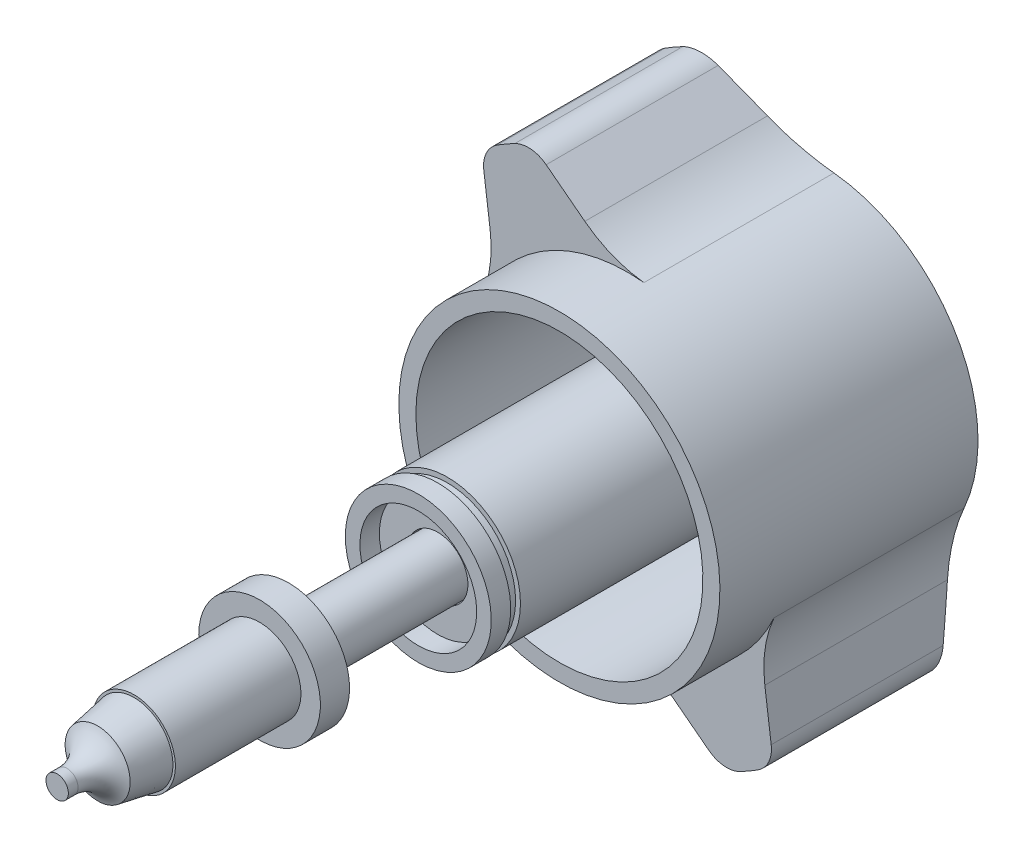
ISO-10303-21;
HEADER;
FILE_DESCRIPTION(('STEP AP214'),'2;1');
FILE_NAME('part.step','',(''),(''),'','','');
FILE_SCHEMA(('AUTOMOTIVE_DESIGN { 1 0 10303 214 1 1 1 1 }'));
ENDSEC;
DATA;
#1=APPLICATION_CONTEXT('core data for automotive mechanical design processes');
#2=APPLICATION_PROTOCOL_DEFINITION('international standard','automotive_design',2000,#1);
#3=PRODUCT_CONTEXT('',#1,'mechanical');
#4=PRODUCT('Part','Part','',(#3));
#5=PRODUCT_RELATED_PRODUCT_CATEGORY('part','',(#4));
#6=PRODUCT_DEFINITION_FORMATION('','',#4);
#7=PRODUCT_DEFINITION_CONTEXT('part definition',#1,'design');
#8=PRODUCT_DEFINITION('design','',#6,#7);
#9=PRODUCT_DEFINITION_SHAPE('','',#8);
#10=(LENGTH_UNIT() NAMED_UNIT(*) SI_UNIT(.MILLI.,.METRE.));
#11=(NAMED_UNIT(*) PLANE_ANGLE_UNIT() SI_UNIT($,.RADIAN.));
#12=(NAMED_UNIT(*) SI_UNIT($,.STERADIAN.) SOLID_ANGLE_UNIT());
#13=UNCERTAINTY_MEASURE_WITH_UNIT(LENGTH_MEASURE(1.E-05),#10,'distance_accuracy_value','');
#14=(GEOMETRIC_REPRESENTATION_CONTEXT(3) GLOBAL_UNCERTAINTY_ASSIGNED_CONTEXT((#13)) GLOBAL_UNIT_ASSIGNED_CONTEXT((#10,
#11,#12)) REPRESENTATION_CONTEXT('',''));
#15=CARTESIAN_POINT('',(0.,0.,0.));
#16=DIRECTION('',(0.,0.,1.));
#17=DIRECTION('',(1.,0.,0.));
#18=AXIS2_PLACEMENT_3D('',#15,#16,#17);
#19=CARTESIAN_POINT('',(0.,0.,-57.2798787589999));
#20=DIRECTION('',(0.,0.,-1.));
#21=DIRECTION('',(0.866025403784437,0.5,0.));
#22=AXIS2_PLACEMENT_3D('',#19,#20,#21);
#23=PLANE('',#22);
#24=DIRECTION('',(-0.5,-0.86602540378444,0.));
#25=VECTOR('',#24,1.);
#26=CARTESIAN_POINT('',(1.44337567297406,0.,-57.2798787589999));
#27=LINE('',#26,#25);
#28=CARTESIAN_POINT('',(1.44337567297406,0.,-57.2798787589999));
#29=VERTEX_POINT('',#28);
#30=CARTESIAN_POINT('',(0.721687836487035,-1.25,-57.2798787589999));
#31=VERTEX_POINT('',#30);
#32=EDGE_CURVE('E35',#29,#31,#27,.T.);
#33=ORIENTED_EDGE('',*,*,#32,.F.);
#34=DIRECTION('',(0.5,-0.866025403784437,0.));
#35=VECTOR('',#34,1.);
#36=CARTESIAN_POINT('',(0.721687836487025,1.25,-57.2798787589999));
#37=LINE('',#36,#35);
#38=CARTESIAN_POINT('',(0.721687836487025,1.25,-57.2798787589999));
#39=VERTEX_POINT('',#38);
#40=EDGE_CURVE('E219',#39,#29,#37,.T.);
#41=ORIENTED_EDGE('',*,*,#40,.F.);
#42=DIRECTION('',(1.,0.,0.));
#43=VECTOR('',#42,1.);
#44=CARTESIAN_POINT('',(-0.721687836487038,1.25,-57.2798787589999));
#45=LINE('',#44,#43);
#46=CARTESIAN_POINT('',(-0.721687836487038,1.25,-57.2798787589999));
#47=VERTEX_POINT('',#46);
#48=EDGE_CURVE('E191',#47,#39,#45,.T.);
#49=ORIENTED_EDGE('',*,*,#48,.F.);
#50=DIRECTION('',(0.5,0.866025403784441,0.));
#51=VECTOR('',#50,1.);
#52=CARTESIAN_POINT('',(-1.44337567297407,0.,-57.2798787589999));
#53=LINE('',#52,#51);
#54=CARTESIAN_POINT('',(-1.44337567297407,0.,-57.2798787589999));
#55=VERTEX_POINT('',#54);
#56=EDGE_CURVE('E215',#55,#47,#53,.T.);
#57=ORIENTED_EDGE('',*,*,#56,.F.);
#58=DIRECTION('',(-0.5,0.866025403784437,0.));
#59=VECTOR('',#58,1.);
#60=CARTESIAN_POINT('',(-0.721687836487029,-1.25,-57.2798787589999));
#61=LINE('',#60,#59);
#62=CARTESIAN_POINT('',(-0.721687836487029,-1.25,-57.2798787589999));
#63=VERTEX_POINT('',#62);
#64=EDGE_CURVE('E213',#63,#55,#61,.T.);
#65=ORIENTED_EDGE('',*,*,#64,.F.);
#66=DIRECTION('',(-1.,0.,0.));
#67=VECTOR('',#66,1.);
#68=CARTESIAN_POINT('',(0.721687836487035,-1.25,-57.2798787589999));
#69=LINE('',#68,#67);
#70=EDGE_CURVE('E210',#31,#63,#69,.T.);
#71=ORIENTED_EDGE('',*,*,#70,.F.);
#72=EDGE_LOOP('',(#33,#41,#49,#57,#65,#71));
#73=FACE_BOUND('',#72,.T.);
#74=CARTESIAN_POINT('',(0.,0.,-57.2798787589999));
#75=DIRECTION('',(0.,0.,-1.));
#76=DIRECTION('',(0.866025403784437,0.5,0.));
#77=AXIS2_PLACEMENT_3D('',#74,#75,#76);
#78=CIRCLE('',#77,4.1);
#79=CARTESIAN_POINT('',(3.55070415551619,2.05,-57.2798787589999));
#80=VERTEX_POINT('',#79);
#81=EDGE_CURVE('E10',#80,#80,#78,.T.);
#82=ORIENTED_EDGE('',*,*,#81,.T.);
#83=EDGE_LOOP('',(#82));
#84=FACE_BOUND('',#83,.T.);
#85=ADVANCED_FACE('F16',(#73,#84),#23,.T.);
#86=CARTESIAN_POINT('',(0.,0.,-57.2798787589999));
#87=DIRECTION('',(0.,0.,-1.));
#88=DIRECTION('',(0.866025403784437,0.5,0.));
#89=AXIS2_PLACEMENT_3D('',#86,#87,#88);
#90=CYLINDRICAL_SURFACE('',#89,4.1);
#91=CARTESIAN_POINT('',(0.,0.,-57.0798787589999));
#92=DIRECTION('',(0.,0.,-1.));
#93=DIRECTION('',(0.866025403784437,0.5,0.));
#94=AXIS2_PLACEMENT_3D('',#91,#92,#93);
#95=CIRCLE('',#94,4.1);
#96=CARTESIAN_POINT('',(3.55070415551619,2.05,-57.0798787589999));
#97=VERTEX_POINT('',#96);
#98=EDGE_CURVE('E26',#97,#97,#95,.T.);
#99=ORIENTED_EDGE('',*,*,#98,.T.);
#100=EDGE_LOOP('',(#99));
#101=FACE_BOUND('',#100,.T.);
#102=ORIENTED_EDGE('',*,*,#81,.F.);
#103=EDGE_LOOP('',(#102));
#104=FACE_BOUND('',#103,.T.);
#105=ADVANCED_FACE('F477',(#101,#104),#90,.T.);
#106=CARTESIAN_POINT('',(1.44337567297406,0.,-55.7798787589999));
#107=DIRECTION('',(0.86602540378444,-0.5,0.));
#108=DIRECTION('',(-0.5,-0.86602540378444,0.));
#109=AXIS2_PLACEMENT_3D('',#106,#107,#108);
#110=PLANE('',#109);
#111=ORIENTED_EDGE('',*,*,#32,.T.);
#112=DIRECTION('',(0.,0.,-1.));
#113=VECTOR('',#112,1.);
#114=CARTESIAN_POINT('',(0.721687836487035,-1.25,-55.7798787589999));
#115=LINE('',#114,#113);
#116=CARTESIAN_POINT('',(0.721687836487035,-1.25,-55.7798787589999));
#117=VERTEX_POINT('',#116);
#118=EDGE_CURVE('E175',#117,#31,#115,.T.);
#119=ORIENTED_EDGE('',*,*,#118,.F.);
#120=DIRECTION('',(-0.5,-0.86602540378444,0.));
#121=VECTOR('',#120,1.);
#122=CARTESIAN_POINT('',(1.44337567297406,0.,-55.7798787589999));
#123=LINE('',#122,#121);
#124=CARTESIAN_POINT('',(1.44337567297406,0.,-55.7798787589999));
#125=VERTEX_POINT('',#124);
#126=EDGE_CURVE('E221',#125,#117,#123,.T.);
#127=ORIENTED_EDGE('',*,*,#126,.F.);
#128=DIRECTION('',(0.,0.,-1.));
#129=VECTOR('',#128,1.);
#130=CARTESIAN_POINT('',(1.44337567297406,0.,-55.7798787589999));
#131=LINE('',#130,#129);
#132=EDGE_CURVE('E172',#125,#29,#131,.T.);
#133=ORIENTED_EDGE('',*,*,#132,.T.);
#134=EDGE_LOOP('',(#111,#119,#127,#133));
#135=FACE_BOUND('',#134,.T.);
#136=ADVANCED_FACE('F484',(#135),#110,.F.);
#137=CARTESIAN_POINT('',(0.721687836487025,1.25,-55.7798787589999));
#138=DIRECTION('',(0.866025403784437,0.5,0.));
#139=DIRECTION('',(0.5,-0.866025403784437,0.));
#140=AXIS2_PLACEMENT_3D('',#137,#138,#139);
#141=PLANE('',#140);
#142=ORIENTED_EDGE('',*,*,#40,.T.);
#143=ORIENTED_EDGE('',*,*,#132,.F.);
#144=DIRECTION('',(0.5,-0.866025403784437,0.));
#145=VECTOR('',#144,1.);
#146=CARTESIAN_POINT('',(0.721687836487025,1.25,-55.7798787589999));
#147=LINE('',#146,#145);
#148=CARTESIAN_POINT('',(0.721687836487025,1.25,-55.7798787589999));
#149=VERTEX_POINT('',#148);
#150=EDGE_CURVE('E199',#149,#125,#147,.T.);
#151=ORIENTED_EDGE('',*,*,#150,.F.);
#152=DIRECTION('',(0.,0.,-1.));
#153=VECTOR('',#152,1.);
#154=CARTESIAN_POINT('',(0.721687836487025,1.25,-55.7798787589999));
#155=LINE('',#154,#153);
#156=EDGE_CURVE('E168',#149,#39,#155,.T.);
#157=ORIENTED_EDGE('',*,*,#156,.T.);
#158=EDGE_LOOP('',(#142,#143,#151,#157));
#159=FACE_BOUND('',#158,.T.);
#160=ADVANCED_FACE('F204',(#159),#141,.F.);
#161=CARTESIAN_POINT('',(-0.721687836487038,1.25,-55.7798787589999));
#162=DIRECTION('',(0.,1.,0.));
#163=DIRECTION('',(1.,0.,0.));
#164=AXIS2_PLACEMENT_3D('',#161,#162,#163);
#165=PLANE('',#164);
#166=ORIENTED_EDGE('',*,*,#48,.T.);
#167=ORIENTED_EDGE('',*,*,#156,.F.);
#168=DIRECTION('',(1.,0.,0.));
#169=VECTOR('',#168,1.);
#170=CARTESIAN_POINT('',(-0.721687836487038,1.25,-55.7798787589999));
#171=LINE('',#170,#169);
#172=CARTESIAN_POINT('',(-0.721687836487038,1.25,-55.7798787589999));
#173=VERTEX_POINT('',#172);
#174=EDGE_CURVE('E188',#173,#149,#171,.T.);
#175=ORIENTED_EDGE('',*,*,#174,.F.);
#176=DIRECTION('',(0.,0.,-1.));
#177=VECTOR('',#176,1.);
#178=CARTESIAN_POINT('',(-0.721687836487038,1.25,-55.7798787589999));
#179=LINE('',#178,#177);
#180=EDGE_CURVE('E193',#173,#47,#179,.T.);
#181=ORIENTED_EDGE('',*,*,#180,.T.);
#182=EDGE_LOOP('',(#166,#167,#175,#181));
#183=FACE_BOUND('',#182,.T.);
#184=ADVANCED_FACE('F187',(#183),#165,.F.);
#185=CARTESIAN_POINT('',(-1.44337567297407,0.,-55.7798787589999));
#186=DIRECTION('',(-0.86602540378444,0.5,0.));
#187=DIRECTION('',(0.5,0.866025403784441,0.));
#188=AXIS2_PLACEMENT_3D('',#185,#186,#187);
#189=PLANE('',#188);
#190=ORIENTED_EDGE('',*,*,#56,.T.);
#191=ORIENTED_EDGE('',*,*,#180,.F.);
#192=DIRECTION('',(0.5,0.866025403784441,0.));
#193=VECTOR('',#192,1.);
#194=CARTESIAN_POINT('',(-1.44337567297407,0.,-55.7798787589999));
#195=LINE('',#194,#193);
#196=CARTESIAN_POINT('',(-1.44337567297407,0.,-55.7798787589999));
#197=VERTEX_POINT('',#196);
#198=EDGE_CURVE('E202',#197,#173,#195,.T.);
#199=ORIENTED_EDGE('',*,*,#198,.F.);
#200=DIRECTION('',(0.,0.,-1.));
#201=VECTOR('',#200,1.);
#202=CARTESIAN_POINT('',(-1.44337567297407,0.,-55.7798787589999));
#203=LINE('',#202,#201);
#204=EDGE_CURVE('E224',#197,#55,#203,.T.);
#205=ORIENTED_EDGE('',*,*,#204,.T.);
#206=EDGE_LOOP('',(#190,#191,#199,#205));
#207=FACE_BOUND('',#206,.T.);
#208=ADVANCED_FACE('F834',(#207),#189,.F.);
#209=CARTESIAN_POINT('',(-0.721687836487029,-1.25,-55.7798787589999));
#210=DIRECTION('',(-0.866025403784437,-0.5,0.));
#211=DIRECTION('',(0.,0.,-1.));
#212=AXIS2_PLACEMENT_3D('',#209,#210,#211);
#213=PLANE('',#212);
#214=ORIENTED_EDGE('',*,*,#64,.T.);
#215=ORIENTED_EDGE('',*,*,#204,.F.);
#216=DIRECTION('',(-0.5,0.866025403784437,0.));
#217=VECTOR('',#216,1.);
#218=CARTESIAN_POINT('',(-0.721687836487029,-1.25,-55.7798787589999));
#219=LINE('',#218,#217);
#220=CARTESIAN_POINT('',(-0.721687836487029,-1.25,-55.7798787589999));
#221=VERTEX_POINT('',#220);
#222=EDGE_CURVE('E889',#221,#197,#219,.T.);
#223=ORIENTED_EDGE('',*,*,#222,.F.);
#224=DIRECTION('',(0.,0.,-1.));
#225=VECTOR('',#224,1.);
#226=CARTESIAN_POINT('',(-0.721687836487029,-1.25,-55.7798787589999));
#227=LINE('',#226,#225);
#228=EDGE_CURVE('E154',#221,#63,#227,.T.);
#229=ORIENTED_EDGE('',*,*,#228,.T.);
#230=EDGE_LOOP('',(#214,#215,#223,#229));
#231=FACE_BOUND('',#230,.T.);
#232=ADVANCED_FACE('F826',(#231),#213,.F.);
#233=CARTESIAN_POINT('',(0.721687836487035,-1.25,-55.7798787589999));
#234=DIRECTION('',(0.,-1.,0.));
#235=DIRECTION('',(-1.,0.,0.));
#236=AXIS2_PLACEMENT_3D('',#233,#234,#235);
#237=PLANE('',#236);
#238=ORIENTED_EDGE('',*,*,#70,.T.);
#239=ORIENTED_EDGE('',*,*,#228,.F.);
#240=DIRECTION('',(-1.,0.,0.));
#241=VECTOR('',#240,1.);
#242=CARTESIAN_POINT('',(0.721687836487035,-1.25,-55.7798787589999));
#243=LINE('',#242,#241);
#244=EDGE_CURVE('E888',#117,#221,#243,.T.);
#245=ORIENTED_EDGE('',*,*,#244,.F.);
#246=ORIENTED_EDGE('',*,*,#118,.T.);
#247=EDGE_LOOP('',(#238,#239,#245,#246));
#248=FACE_BOUND('',#247,.T.);
#249=ADVANCED_FACE('F819',(#248),#237,.F.);
#250=CARTESIAN_POINT('',(0.721687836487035,-1.25,-55.7798787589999));
#251=DIRECTION('',(0.,0.,-1.));
#252=DIRECTION('',(0.866025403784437,0.5,0.));
#253=AXIS2_PLACEMENT_3D('',#250,#251,#252);
#254=PLANE('',#253);
#255=ORIENTED_EDGE('',*,*,#126,.T.);
#256=ORIENTED_EDGE('',*,*,#244,.T.);
#257=ORIENTED_EDGE('',*,*,#222,.T.);
#258=ORIENTED_EDGE('',*,*,#198,.T.);
#259=ORIENTED_EDGE('',*,*,#174,.T.);
#260=ORIENTED_EDGE('',*,*,#150,.T.);
#261=EDGE_LOOP('',(#255,#256,#257,#258,#259,#260));
#262=FACE_BOUND('',#261,.T.);
#263=ADVANCED_FACE('F198',(#262),#254,.T.);
#264=CARTESIAN_POINT('',(1.15,0.,22.1838411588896));
#265=DIRECTION('',(0.,0.,1.));
#266=DIRECTION('',(1.,0.,0.));
#267=AXIS2_PLACEMENT_3D('',#264,#265,#266);
#268=PLANE('',#267);
#269=CARTESIAN_POINT('',(0.,0.,22.1838411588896));
#270=DIRECTION('',(0.,0.,1.));
#271=DIRECTION('',(1.,0.,0.));
#272=AXIS2_PLACEMENT_3D('',#269,#270,#271);
#273=CIRCLE('',#272,1.15);
#274=CARTESIAN_POINT('',(1.15,0.,22.1838411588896));
#275=VERTEX_POINT('',#274);
#276=EDGE_CURVE('E981',#275,#275,#273,.T.);
#277=ORIENTED_EDGE('',*,*,#276,.T.);
#278=EDGE_LOOP('',(#277));
#279=FACE_BOUND('',#278,.T.);
#280=ADVANCED_FACE('F18',(#279),#268,.T.);
#281=CARTESIAN_POINT('',(0.,0.,16.5408677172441));
#282=DIRECTION('',(0.,0.,1.));
#283=DIRECTION('',(1.,0.,0.));
#284=AXIS2_PLACEMENT_3D('',#281,#282,#283);
#285=CYLINDRICAL_SURFACE('',#284,1.15);
#286=CARTESIAN_POINT('',(0.,0.,21.1838411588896));
#287=DIRECTION('',(0.,0.,1.));
#288=DIRECTION('',(1.,0.,0.));
#289=AXIS2_PLACEMENT_3D('',#286,#287,#288);
#290=CIRCLE('',#289,1.15);
#291=CARTESIAN_POINT('',(1.15,0.,21.1838411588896));
#292=VERTEX_POINT('',#291);
#293=EDGE_CURVE('E980',#292,#292,#290,.T.);
#294=ORIENTED_EDGE('',*,*,#293,.T.);
#295=EDGE_LOOP('',(#294));
#296=FACE_BOUND('',#295,.T.);
#297=ORIENTED_EDGE('',*,*,#276,.F.);
#298=EDGE_LOOP('',(#297));
#299=FACE_BOUND('',#298,.T.);
#300=ADVANCED_FACE('F463',(#296,#299),#285,.T.);
#301=CARTESIAN_POINT('',(0.,0.,21.1838411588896));
#302=DIRECTION('',(0.,0.,1.));
#303=DIRECTION('',(1.,0.,0.));
#304=AXIS2_PLACEMENT_3D('',#301,#302,#303);
#305=TOROIDAL_SURFACE('',#304,4.525,3.375);
#306=CARTESIAN_POINT('',(0.,0.,18.0234900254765));
#307=DIRECTION('',(0.,0.,1.));
#308=DIRECTION('',(1.,0.,0.));
#309=AXIS2_PLACEMENT_3D('',#306,#307,#308);
#310=CIRCLE('',#309,3.34059900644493);
#311=CARTESIAN_POINT('',(3.34059900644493,0.,18.0234900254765));
#312=VERTEX_POINT('',#311);
#313=EDGE_CURVE('E977',#312,#312,#310,.T.);
#314=ORIENTED_EDGE('',*,*,#313,.T.);
#315=EDGE_LOOP('',(#314));
#316=FACE_BOUND('',#315,.T.);
#317=ORIENTED_EDGE('',*,*,#293,.F.);
#318=EDGE_LOOP('',(#317));
#319=FACE_BOUND('',#318,.T.);
#320=ADVANCED_FACE('F460',(#316,#319),#305,.F.);
#321=CARTESIAN_POINT('',(0.,0.,18.0234900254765));
#322=DIRECTION('',(0.,0.,-1.));
#323=DIRECTION('',(-1.,0.,0.));
#324=AXIS2_PLACEMENT_3D('',#321,#322,#323);
#325=CONICAL_SURFACE('',#324,3.34059900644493,0.174532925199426);
#326=CARTESIAN_POINT('',(0.,0.,14.2838411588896));
#327=DIRECTION('',(0.,0.,1.));
#328=DIRECTION('',(1.,0.,0.));
#329=AXIS2_PLACEMENT_3D('',#326,#327,#328);
#330=CIRCLE('',#329,4.);
#331=CARTESIAN_POINT('',(4.,0.,14.2838411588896));
#332=VERTEX_POINT('',#331);
#333=EDGE_CURVE('E974',#332,#332,#330,.T.);
#334=ORIENTED_EDGE('',*,*,#333,.T.);
#335=EDGE_LOOP('',(#334));
#336=FACE_BOUND('',#335,.T.);
#337=ORIENTED_EDGE('',*,*,#313,.F.);
#338=EDGE_LOOP('',(#337));
#339=FACE_BOUND('',#338,.T.);
#340=ADVANCED_FACE('F456',(#336,#339),#325,.T.);
#341=CARTESIAN_POINT('',(6.25,0.,14.2838411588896));
#342=DIRECTION('',(0.,0.,1.));
#343=DIRECTION('',(1.,0.,0.));
#344=AXIS2_PLACEMENT_3D('',#341,#342,#343);
#345=PLANE('',#344);
#346=ORIENTED_EDGE('',*,*,#333,.F.);
#347=EDGE_LOOP('',(#346));
#348=FACE_BOUND('',#347,.T.);
#349=CARTESIAN_POINT('',(0.,0.,14.2838411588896));
#350=DIRECTION('',(0.,0.,-1.));
#351=DIRECTION('',(-1.,0.,0.));
#352=AXIS2_PLACEMENT_3D('',#349,#350,#351);
#353=CIRCLE('',#352,4.25);
#354=CARTESIAN_POINT('',(-4.25,0.,14.2838411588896));
#355=VERTEX_POINT('',#354);
#356=EDGE_CURVE('E965',#355,#355,#353,.T.);
#357=ORIENTED_EDGE('',*,*,#356,.F.);
#358=EDGE_LOOP('',(#357));
#359=FACE_BOUND('',#358,.T.);
#360=ADVANCED_FACE('F440',(#348,#359),#345,.T.);
#361=CARTESIAN_POINT('',(0.,0.,-1.61615884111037));
#362=DIRECTION('',(0.,0.,-1.));
#363=DIRECTION('',(-1.,0.,0.));
#364=AXIS2_PLACEMENT_3D('',#361,#362,#363);
#365=CYLINDRICAL_SURFACE('',#364,4.25);
#366=ORIENTED_EDGE('',*,*,#356,.T.);
#367=EDGE_LOOP('',(#366));
#368=FACE_BOUND('',#367,.T.);
#369=CARTESIAN_POINT('',(0.,0.,1.38384115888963));
#370=DIRECTION('',(0.,0.,-1.));
#371=DIRECTION('',(-1.,0.,0.));
#372=AXIS2_PLACEMENT_3D('',#369,#370,#371);
#373=CIRCLE('',#372,4.25);
#374=CARTESIAN_POINT('',(-4.25,0.,1.38384115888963));
#375=VERTEX_POINT('',#374);
#376=EDGE_CURVE('E968',#375,#375,#373,.T.);
#377=ORIENTED_EDGE('',*,*,#376,.F.);
#378=EDGE_LOOP('',(#377));
#379=FACE_BOUND('',#378,.T.);
#380=ADVANCED_FACE('F436',(#368,#379),#365,.T.);
#381=CARTESIAN_POINT('',(6.25,0.,1.38384115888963));
#382=DIRECTION('',(0.,0.,1.));
#383=DIRECTION('',(1.,0.,0.));
#384=AXIS2_PLACEMENT_3D('',#381,#382,#383);
#385=PLANE('',#384);
#386=ORIENTED_EDGE('',*,*,#376,.T.);
#387=EDGE_LOOP('',(#386));
#388=FACE_BOUND('',#387,.T.);
#389=CARTESIAN_POINT('',(0.,0.,1.38384115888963));
#390=DIRECTION('',(0.,0.,-1.));
#391=DIRECTION('',(-1.,0.,0.));
#392=AXIS2_PLACEMENT_3D('',#389,#390,#391);
#393=CIRCLE('',#392,6.25);
#394=CARTESIAN_POINT('',(-6.25,0.,1.38384115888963));
#395=VERTEX_POINT('',#394);
#396=EDGE_CURVE('E971',#395,#395,#393,.T.);
#397=ORIENTED_EDGE('',*,*,#396,.F.);
#398=EDGE_LOOP('',(#397));
#399=FACE_BOUND('',#398,.T.);
#400=ADVANCED_FACE('F439',(#388,#399),#385,.T.);
#401=CARTESIAN_POINT('',(0.,0.,16.5408677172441));
#402=DIRECTION('',(0.,0.,1.));
#403=DIRECTION('',(1.,0.,0.));
#404=AXIS2_PLACEMENT_3D('',#401,#402,#403);
#405=CYLINDRICAL_SURFACE('',#404,6.25);
#406=CARTESIAN_POINT('',(0.,0.,-1.61615884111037));
#407=DIRECTION('',(0.,0.,-1.));
#408=DIRECTION('',(-1.,0.,0.));
#409=AXIS2_PLACEMENT_3D('',#406,#407,#408);
#410=CIRCLE('',#409,6.25);
#411=CARTESIAN_POINT('',(-6.25000000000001,0.,-1.61615884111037));
#412=VERTEX_POINT('',#411);
#413=EDGE_CURVE('E20',#412,#412,#410,.F.);
#414=ORIENTED_EDGE('',*,*,#413,.T.);
#415=EDGE_LOOP('',(#414));
#416=FACE_BOUND('',#415,.T.);
#417=ORIENTED_EDGE('',*,*,#396,.T.);
#418=EDGE_LOOP('',(#417));
#419=FACE_BOUND('',#418,.T.);
#420=ADVANCED_FACE('F444',(#416,#419),#405,.T.);
#421=CARTESIAN_POINT('',(0.,0.,-1.61615884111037));
#422=DIRECTION('',(0.,0.,-1.));
#423=DIRECTION('',(-1.,0.,0.));
#424=AXIS2_PLACEMENT_3D('',#421,#422,#423);
#425=PLANE('',#424);
#426=CARTESIAN_POINT('',(0.,0.,-1.61615884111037));
#427=DIRECTION('',(0.,0.,-1.));
#428=DIRECTION('',(-1.,0.,0.));
#429=AXIS2_PLACEMENT_3D('',#426,#427,#428);
#430=CIRCLE('',#429,3.);
#431=CARTESIAN_POINT('',(-3.,0.,-1.61615884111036));
#432=VERTEX_POINT('',#431);
#433=EDGE_CURVE('E242',#432,#432,#430,.F.);
#434=ORIENTED_EDGE('',*,*,#433,.T.);
#435=EDGE_LOOP('',(#434));
#436=FACE_BOUND('',#435,.T.);
#437=ORIENTED_EDGE('',*,*,#413,.F.);
#438=EDGE_LOOP('',(#437));
#439=FACE_BOUND('',#438,.T.);
#440=ADVANCED_FACE('F446',(#436,#439),#425,.T.);
#441=CARTESIAN_POINT('',(0.,0.,-0.416158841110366));
#442=DIRECTION('',(0.,0.,-1.));
#443=DIRECTION('',(-1.,0.,0.));
#444=AXIS2_PLACEMENT_3D('',#441,#442,#443);
#445=CYLINDRICAL_SURFACE('',#444,3.);
#446=ORIENTED_EDGE('',*,*,#433,.F.);
#447=EDGE_LOOP('',(#446));
#448=FACE_BOUND('',#447,.T.);
#449=CARTESIAN_POINT('',(0.,0.,-17.929878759));
#450=DIRECTION('',(0.,0.,-1.));
#451=DIRECTION('',(-1.,0.,0.));
#452=AXIS2_PLACEMENT_3D('',#449,#450,#451);
#453=CIRCLE('',#452,3.);
#454=CARTESIAN_POINT('',(-3.00000000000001,0.,-17.929878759));
#455=VERTEX_POINT('',#454);
#456=EDGE_CURVE('E233',#455,#455,#453,.F.);
#457=ORIENTED_EDGE('',*,*,#456,.T.);
#458=EDGE_LOOP('',(#457));
#459=FACE_BOUND('',#458,.T.);
#460=ADVANCED_FACE('F449',(#448,#459),#445,.T.);
#461=CARTESIAN_POINT('',(0.,0.,-17.929878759));
#462=DIRECTION('',(0.,0.,-1.));
#463=DIRECTION('',(-0.5,0.866025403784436,0.));
#464=AXIS2_PLACEMENT_3D('',#461,#462,#463);
#465=PLANE('',#464);
#466=ORIENTED_EDGE('',*,*,#456,.F.);
#467=EDGE_LOOP('',(#466));
#468=FACE_BOUND('',#467,.T.);
#469=CARTESIAN_POINT('',(0.,0.,-17.929878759));
#470=DIRECTION('',(0.,0.,-1.));
#471=DIRECTION('',(-0.906728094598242,-0.421715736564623,0.));
#472=AXIS2_PLACEMENT_3D('',#469,#470,#471);
#473=CIRCLE('',#472,3.1);
#474=CARTESIAN_POINT('',(-2.81085709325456,-1.30731878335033,-17.929878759));
#475=VERTEX_POINT('',#474);
#476=EDGE_CURVE('E248',#475,#475,#473,.T.);
#477=ORIENTED_EDGE('',*,*,#476,.F.);
#478=EDGE_LOOP('',(#477));
#479=FACE_BOUND('',#478,.T.);
#480=ADVANCED_FACE('F433',(#468,#479),#465,.F.);
#481=CARTESIAN_POINT('',(0.,0.,-17.929878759));
#482=DIRECTION('',(0.,0.,1.));
#483=DIRECTION('',(0.906728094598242,0.421715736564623,0.));
#484=AXIS2_PLACEMENT_3D('',#481,#482,#483);
#485=CYLINDRICAL_SURFACE('',#484,3.1);
#486=ORIENTED_EDGE('',*,*,#476,.T.);
#487=EDGE_LOOP('',(#486));
#488=FACE_BOUND('',#487,.T.);
#489=CARTESIAN_POINT('',(0.,0.,-16.929878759));
#490=DIRECTION('',(0.,0.,-1.));
#491=DIRECTION('',(-0.906728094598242,-0.421715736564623,0.));
#492=AXIS2_PLACEMENT_3D('',#489,#490,#491);
#493=CIRCLE('',#492,3.1);
#494=CARTESIAN_POINT('',(-2.81085709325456,-1.30731878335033,-16.929878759));
#495=VERTEX_POINT('',#494);
#496=EDGE_CURVE('E251',#495,#495,#493,.T.);
#497=ORIENTED_EDGE('',*,*,#496,.F.);
#498=EDGE_LOOP('',(#497));
#499=FACE_BOUND('',#498,.T.);
#500=ADVANCED_FACE('F508',(#488,#499),#485,.F.);
#501=CARTESIAN_POINT('',(0.,0.,-16.929878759));
#502=DIRECTION('',(0.,0.,-1.));
#503=DIRECTION('',(-0.906728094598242,-0.421715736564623,0.));
#504=AXIS2_PLACEMENT_3D('',#501,#502,#503);
#505=PLANE('',#504);
#506=ORIENTED_EDGE('',*,*,#496,.T.);
#507=EDGE_LOOP('',(#506));
#508=FACE_BOUND('',#507,.T.);
#509=CARTESIAN_POINT('',(0.,0.,-16.929878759));
#510=DIRECTION('',(0.,0.,1.));
#511=DIRECTION('',(0.489724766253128,-0.871877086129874,0.));
#512=AXIS2_PLACEMENT_3D('',#509,#510,#511);
#513=CIRCLE('',#512,6.);
#514=CARTESIAN_POINT('',(2.93834859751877,-5.23126251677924,-16.929878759));
#515=VERTEX_POINT('',#514);
#516=EDGE_CURVE('E236',#515,#515,#513,.T.);
#517=ORIENTED_EDGE('',*,*,#516,.T.);
#518=EDGE_LOOP('',(#517));
#519=FACE_BOUND('',#518,.T.);
#520=ADVANCED_FACE('F473',(#508,#519),#505,.F.);
#521=CARTESIAN_POINT('',(0.,0.,-14.929878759));
#522=DIRECTION('',(0.,0.,1.));
#523=DIRECTION('',(0.489724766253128,-0.871877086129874,0.));
#524=AXIS2_PLACEMENT_3D('',#521,#522,#523);
#525=CYLINDRICAL_SURFACE('',#524,6.);
#526=ORIENTED_EDGE('',*,*,#516,.F.);
#527=EDGE_LOOP('',(#526));
#528=FACE_BOUND('',#527,.T.);
#529=CARTESIAN_POINT('',(0.,0.,-14.929878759));
#530=DIRECTION('',(0.,0.,1.));
#531=DIRECTION('',(0.489724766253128,-0.871877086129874,0.));
#532=AXIS2_PLACEMENT_3D('',#529,#530,#531);
#533=CIRCLE('',#532,6.);
#534=CARTESIAN_POINT('',(2.93834859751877,-5.23126251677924,-14.929878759));
#535=VERTEX_POINT('',#534);
#536=EDGE_CURVE('E232',#535,#535,#533,.T.);
#537=ORIENTED_EDGE('',*,*,#536,.T.);
#538=EDGE_LOOP('',(#537));
#539=FACE_BOUND('',#538,.T.);
#540=ADVANCED_FACE('F493',(#528,#539),#525,.F.);
#541=CARTESIAN_POINT('',(-6.53907814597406,-3.67293574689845,-14.929878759));
#542=DIRECTION('',(0.,0.,-1.));
#543=DIRECTION('',(-0.489724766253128,0.871877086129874,0.));
#544=AXIS2_PLACEMENT_3D('',#541,#542,#543);
#545=PLANE('',#544);
#546=ORIENTED_EDGE('',*,*,#536,.F.);
#547=EDGE_LOOP('',(#546));
#548=FACE_BOUND('',#547,.T.);
#549=CARTESIAN_POINT('',(0.,0.,-14.929878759));
#550=DIRECTION('',(0.,0.,1.));
#551=DIRECTION('',(0.489724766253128,-0.871877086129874,0.));
#552=AXIS2_PLACEMENT_3D('',#549,#550,#551);
#553=CIRCLE('',#552,7.5);
#554=CARTESIAN_POINT('',(3.67293574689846,-6.53907814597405,-14.929878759));
#555=VERTEX_POINT('',#554);
#556=EDGE_CURVE('E229',#555,#555,#553,.T.);
#557=ORIENTED_EDGE('',*,*,#556,.T.);
#558=EDGE_LOOP('',(#557));
#559=FACE_BOUND('',#558,.T.);
#560=ADVANCED_FACE('F490',(#548,#559),#545,.F.);
#561=CARTESIAN_POINT('',(0.,0.,-14.929878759));
#562=DIRECTION('',(0.,0.,1.));
#563=DIRECTION('',(0.489724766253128,-0.871877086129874,0.));
#564=AXIS2_PLACEMENT_3D('',#561,#562,#563);
#565=CYLINDRICAL_SURFACE('',#564,7.5);
#566=ORIENTED_EDGE('',*,*,#556,.F.);
#567=EDGE_LOOP('',(#566));
#568=FACE_BOUND('',#567,.T.);
#569=CARTESIAN_POINT('',(0.,0.,-16.929878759));
#570=DIRECTION('',(0.,0.,1.));
#571=DIRECTION('',(0.489724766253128,-0.871877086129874,0.));
#572=AXIS2_PLACEMENT_3D('',#569,#570,#571);
#573=CIRCLE('',#572,7.5);
#574=CARTESIAN_POINT('',(3.67293574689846,-6.53907814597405,-16.929878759));
#575=VERTEX_POINT('',#574);
#576=EDGE_CURVE('E239',#575,#575,#573,.T.);
#577=ORIENTED_EDGE('',*,*,#576,.T.);
#578=EDGE_LOOP('',(#577));
#579=FACE_BOUND('',#578,.T.);
#580=ADVANCED_FACE('F434',(#568,#579),#565,.T.);
#581=CARTESIAN_POINT('',(-6.53907814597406,-3.67293574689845,-16.929878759));
#582=DIRECTION('',(0.,0.,1.));
#583=DIRECTION('',(0.489724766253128,-0.871877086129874,0.));
#584=AXIS2_PLACEMENT_3D('',#581,#582,#583);
#585=PLANE('',#584);
#586=CARTESIAN_POINT('',(0.,0.,-16.929878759));
#587=DIRECTION('',(0.,0.,-1.));
#588=DIRECTION('',(-0.906728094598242,-0.421715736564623,0.));
#589=AXIS2_PLACEMENT_3D('',#586,#587,#588);
#590=CIRCLE('',#589,7.);
#591=CARTESIAN_POINT('',(-6.3470966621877,-2.95201015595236,-16.929878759));
#592=VERTEX_POINT('',#591);
#593=EDGE_CURVE('E211',#592,#592,#590,.T.);
#594=ORIENTED_EDGE('',*,*,#593,.F.);
#595=EDGE_LOOP('',(#594));
#596=FACE_BOUND('',#595,.T.);
#597=ORIENTED_EDGE('',*,*,#576,.F.);
#598=EDGE_LOOP('',(#597));
#599=FACE_BOUND('',#598,.T.);
#600=ADVANCED_FACE('F498',(#596,#599),#585,.F.);
#601=CARTESIAN_POINT('',(0.,0.,-17.929878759));
#602=DIRECTION('',(0.,0.,1.));
#603=DIRECTION('',(0.906728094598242,0.421715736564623,0.));
#604=AXIS2_PLACEMENT_3D('',#601,#602,#603);
#605=CYLINDRICAL_SURFACE('',#604,7.);
#606=CARTESIAN_POINT('',(0.,0.,-17.929878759));
#607=DIRECTION('',(0.,0.,-1.));
#608=DIRECTION('',(-0.906728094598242,-0.421715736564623,0.));
#609=AXIS2_PLACEMENT_3D('',#606,#607,#608);
#610=CIRCLE('',#609,7.);
#611=CARTESIAN_POINT('',(-6.3470966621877,-2.95201015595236,-17.929878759));
#612=VERTEX_POINT('',#611);
#613=EDGE_CURVE('E245',#612,#612,#610,.T.);
#614=ORIENTED_EDGE('',*,*,#613,.F.);
#615=EDGE_LOOP('',(#614));
#616=FACE_BOUND('',#615,.T.);
#617=ORIENTED_EDGE('',*,*,#593,.T.);
#618=EDGE_LOOP('',(#617));
#619=FACE_BOUND('',#618,.T.);
#620=ADVANCED_FACE('F429',(#616,#619),#605,.T.);
#621=CARTESIAN_POINT('',(0.,0.,-17.929878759));
#622=DIRECTION('',(0.,0.,-1.));
#623=DIRECTION('',(-0.5,0.866025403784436,0.));
#624=AXIS2_PLACEMENT_3D('',#621,#622,#623);
#625=CIRCLE('',#624,7.5);
#626=CARTESIAN_POINT('',(-3.75,6.49519052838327,-17.929878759));
#627=VERTEX_POINT('',#626);
#628=EDGE_CURVE('E263',#627,#627,#625,.T.);
#629=ORIENTED_EDGE('',*,*,#628,.F.);
#630=EDGE_LOOP('',(#629));
#631=FACE_BOUND('',#630,.T.);
#632=ORIENTED_EDGE('',*,*,#613,.T.);
#633=EDGE_LOOP('',(#632));
#634=FACE_BOUND('',#633,.T.);
#635=ADVANCED_FACE('F426',(#631,#634),#465,.F.);
#636=CARTESIAN_POINT('',(0.,0.,-17.929878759));
#637=DIRECTION('',(0.,0.,-1.));
#638=DIRECTION('',(-0.5,0.866025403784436,0.));
#639=AXIS2_PLACEMENT_3D('',#636,#637,#638);
#640=CYLINDRICAL_SURFACE('',#639,7.5);
#641=CARTESIAN_POINT('',(0.,0.,-49.429878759));
#642=DIRECTION('',(0.,0.,1.));
#643=DIRECTION('',(1.,0.,0.));
#644=AXIS2_PLACEMENT_3D('',#641,#642,#643);
#645=CIRCLE('',#644,7.5);
#646=CARTESIAN_POINT('',(7.5,0.,-49.429878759));
#647=VERTEX_POINT('',#646);
#648=EDGE_CURVE('E254',#647,#647,#645,.F.);
#649=ORIENTED_EDGE('',*,*,#648,.F.);
#650=EDGE_LOOP('',(#649));
#651=FACE_BOUND('',#650,.T.);
#652=ORIENTED_EDGE('',*,*,#628,.T.);
#653=EDGE_LOOP('',(#652));
#654=FACE_BOUND('',#653,.T.);
#655=ADVANCED_FACE('F423',(#651,#654),#640,.T.);
#656=CARTESIAN_POINT('',(0.,0.,-49.429878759));
#657=DIRECTION('',(0.,0.,1.));
#658=DIRECTION('',(-0.866025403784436,-0.5,0.));
#659=AXIS2_PLACEMENT_3D('',#656,#657,#658);
#660=PLANE('',#659);
#661=ORIENTED_EDGE('',*,*,#648,.T.);
#662=EDGE_LOOP('',(#661));
#663=FACE_BOUND('',#662,.T.);
#664=CARTESIAN_POINT('',(0.,0.,-49.429878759));
#665=DIRECTION('',(0.,0.,1.));
#666=DIRECTION('',(-0.866025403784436,-0.5,0.));
#667=AXIS2_PLACEMENT_3D('',#664,#665,#666);
#668=CIRCLE('',#667,10.5);
#669=CARTESIAN_POINT('',(-9.09326673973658,-5.25,-49.429878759));
#670=VERTEX_POINT('',#669);
#671=EDGE_CURVE('E953',#670,#670,#668,.F.);
#672=ORIENTED_EDGE('',*,*,#671,.F.);
#673=EDGE_LOOP('',(#672));
#674=FACE_BOUND('',#673,.T.);
#675=ADVANCED_FACE('F307',(#663,#674),#660,.T.);
#676=CARTESIAN_POINT('',(0.,0.,-36.429878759));
#677=DIRECTION('',(0.,0.,1.));
#678=DIRECTION('',(-0.866025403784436,-0.5,0.));
#679=AXIS2_PLACEMENT_3D('',#676,#677,#678);
#680=CYLINDRICAL_SURFACE('',#679,10.5);
#681=ORIENTED_EDGE('',*,*,#671,.T.);
#682=EDGE_LOOP('',(#681));
#683=FACE_BOUND('',#682,.T.);
#684=CARTESIAN_POINT('',(0.,0.,-54.429878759));
#685=DIRECTION('',(0.,0.,1.));
#686=DIRECTION('',(-0.866025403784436,-0.5,0.));
#687=AXIS2_PLACEMENT_3D('',#684,#685,#686);
#688=CIRCLE('',#687,10.5);
#689=CARTESIAN_POINT('',(-9.09326673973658,-5.25,-54.429878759));
#690=VERTEX_POINT('',#689);
#691=EDGE_CURVE('E259',#690,#690,#688,.T.);
#692=ORIENTED_EDGE('',*,*,#691,.T.);
#693=EDGE_LOOP('',(#692));
#694=FACE_BOUND('',#693,.T.);
#695=ADVANCED_FACE('F518',(#683,#694),#680,.T.);
#696=CARTESIAN_POINT('',(7.375,-12.7738747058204,-54.429878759));
#697=DIRECTION('',(0.,0.,-1.));
#698=DIRECTION('',(0.866025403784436,0.5,0.));
#699=AXIS2_PLACEMENT_3D('',#696,#697,#698);
#700=PLANE('',#699);
#701=ORIENTED_EDGE('',*,*,#691,.F.);
#702=EDGE_LOOP('',(#701));
#703=FACE_BOUND('',#702,.T.);
#704=CARTESIAN_POINT('',(0.,0.,-54.429878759));
#705=DIRECTION('',(0.,0.,1.));
#706=DIRECTION('',(-0.866025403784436,-0.5,0.));
#707=AXIS2_PLACEMENT_3D('',#704,#705,#706);
#708=CIRCLE('',#707,14.75);
#709=CARTESIAN_POINT('',(-12.7738747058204,-7.375,-54.429878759));
#710=VERTEX_POINT('',#709);
#711=EDGE_CURVE('E262',#710,#710,#708,.T.);
#712=ORIENTED_EDGE('',*,*,#711,.T.);
#713=EDGE_LOOP('',(#712));
#714=FACE_BOUND('',#713,.T.);
#715=ADVANCED_FACE('F521',(#703,#714),#700,.F.);
#716=CARTESIAN_POINT('',(0.,0.,-36.429878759));
#717=DIRECTION('',(0.,0.,-1.));
#718=DIRECTION('',(0.866025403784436,0.5,0.));
#719=AXIS2_PLACEMENT_3D('',#716,#717,#718);
#720=CYLINDRICAL_SURFACE('',#719,14.75);
#721=CARTESIAN_POINT('',(0.,0.,-29.429878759));
#722=DIRECTION('',(0.,0.,1.));
#723=DIRECTION('',(-0.866025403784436,-0.5,0.));
#724=AXIS2_PLACEMENT_3D('',#721,#722,#723);
#725=CIRCLE('',#724,14.75);
#726=CARTESIAN_POINT('',(-12.7738747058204,-7.375,-29.429878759));
#727=VERTEX_POINT('',#726);
#728=EDGE_CURVE('E266',#727,#727,#725,.T.);
#729=ORIENTED_EDGE('',*,*,#728,.T.);
#730=EDGE_LOOP('',(#729));
#731=FACE_BOUND('',#730,.T.);
#732=ORIENTED_EDGE('',*,*,#711,.F.);
#733=EDGE_LOOP('',(#732));
#734=FACE_BOUND('',#733,.T.);
#735=ADVANCED_FACE('F525',(#731,#734),#720,.F.);
#736=CARTESIAN_POINT('',(0.,0.,-29.429878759));
#737=DIRECTION('',(0.,0.,1.));
#738=DIRECTION('',(-0.866025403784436,-0.5,0.));
#739=AXIS2_PLACEMENT_3D('',#736,#737,#738);
#740=PLANE('',#739);
#741=CARTESIAN_POINT('',(0.,0.,-29.429878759));
#742=DIRECTION('',(0.,0.,1.));
#743=DIRECTION('',(-0.866025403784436,-0.5,0.));
#744=AXIS2_PLACEMENT_3D('',#741,#742,#743);
#745=CIRCLE('',#744,16.5);
#746=CARTESIAN_POINT('',(-14.2894191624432,-8.25,-29.429878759));
#747=VERTEX_POINT('',#746);
#748=EDGE_CURVE('E270',#747,#747,#745,.T.);
#749=ORIENTED_EDGE('',*,*,#748,.T.);
#750=EDGE_LOOP('',(#749));
#751=FACE_BOUND('',#750,.T.);
#752=ORIENTED_EDGE('',*,*,#728,.F.);
#753=EDGE_LOOP('',(#752));
#754=FACE_BOUND('',#753,.T.);
#755=ADVANCED_FACE('F435',(#751,#754),#740,.T.);
#756=CARTESIAN_POINT('',(0.,0.,-36.429878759));
#757=DIRECTION('',(0.,0.,1.));
#758=DIRECTION('',(-0.866025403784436,-0.5,0.));
#759=AXIS2_PLACEMENT_3D('',#756,#757,#758);
#760=PLANE('',#759);
#761=CARTESIAN_POINT('',(0.,0.,-36.429878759));
#762=DIRECTION('',(0.,0.,-1.));
#763=DIRECTION('',(0.866025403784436,0.5,0.));
#764=AXIS2_PLACEMENT_3D('',#761,#762,#763);
#765=CIRCLE('',#764,25.);
#766=CARTESIAN_POINT('',(-13.4028665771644,21.1036292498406,-36.429878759));
#767=VERTEX_POINT('',#766);
#768=CARTESIAN_POINT('',(-11.5748457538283,22.159037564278,-36.429878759));
#769=VERTEX_POINT('',#768);
#770=EDGE_CURVE('E1051',#767,#769,#765,.T.);
#771=ORIENTED_EDGE('',*,*,#770,.F.);
#772=CARTESIAN_POINT('',(-11.7945225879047,18.5711937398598,-36.429878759));
#773=DIRECTION('',(0.,0.,1.));
#774=DIRECTION('',(-0.866025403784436,-0.5,0.));
#775=AXIS2_PLACEMENT_3D('',#772,#773,#774);
#776=CIRCLE('',#775,3.);
#777=CARTESIAN_POINT('',(-14.7688571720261,18.1796151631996,-36.429878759));
#778=VERTEX_POINT('',#777);
#779=EDGE_CURVE('E145',#767,#778,#776,.T.);
#780=ORIENTED_EDGE('',*,*,#779,.T.);
#781=DIRECTION('',(-0.130526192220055,0.99144486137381,0.));
#782=VECTOR('',#781,1.);
#783=CARTESIAN_POINT('',(-13.604600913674,9.33621090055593,-36.429878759));
#784=LINE('',#783,#782);
#785=CARTESIAN_POINT('',(-14.1148304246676,13.2117888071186,-36.429878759));
#786=VERTEX_POINT('',#785);
#787=EDGE_CURVE('E1053',#786,#778,#784,.T.);
#788=ORIENTED_EDGE('',*,*,#787,.F.);
#789=CARTESIAN_POINT('',(-26.0121687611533,11.6454745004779,-36.429878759));
#790=DIRECTION('',(0.,0.,1.));
#791=DIRECTION('',(-0.866025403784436,-0.5,0.));
#792=AXIS2_PLACEMENT_3D('',#789,#790,#791);
#793=CIRCLE('',#792,12.);
#794=CARTESIAN_POINT('',(-15.059676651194,6.74211681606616,-36.429878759));
#795=VERTEX_POINT('',#794);
#796=EDGE_CURVE('E1080',#786,#795,#793,.F.);
#797=ORIENTED_EDGE('',*,*,#796,.T.);
#798=CARTESIAN_POINT('',(0.,0.,-36.429878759));
#799=DIRECTION('',(0.,0.,1.));
#800=DIRECTION('',(-0.866025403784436,-0.5,0.));
#801=AXIS2_PLACEMENT_3D('',#798,#799,#800);
#802=CIRCLE('',#801,16.5);
#803=CARTESIAN_POINT('',(1.69099388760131,16.4131209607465,-36.429878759));
#804=VERTEX_POINT('',#803);
#805=EDGE_CURVE('E275',#804,#795,#802,.T.);
#806=ORIENTED_EDGE('',*,*,#805,.F.);
#807=CARTESIAN_POINT('',(2.92080762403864,28.3499362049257,-36.429878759));
#808=DIRECTION('',(0.,0.,1.));
#809=DIRECTION('',(-0.866025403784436,-0.5,0.));
#810=AXIS2_PLACEMENT_3D('',#807,#808,#809);
#811=CIRCLE('',#810,12.);
#812=CARTESIAN_POINT('',(-4.38432952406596,18.8296961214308,-36.429878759));
#813=VERTEX_POINT('',#812);
#814=EDGE_CURVE('E1095',#804,#813,#811,.F.);
#815=ORIENTED_EDGE('',*,*,#814,.T.);
#816=DIRECTION('',(0.793353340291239,-0.608761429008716,0.));
#817=VECTOR('',#816,1.);
#818=CARTESIAN_POINT('',(-1.28309535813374,16.4500354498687,-36.429878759));
#819=LINE('',#818,#817);
#820=CARTESIAN_POINT('',(-8.35957997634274,21.8800130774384,-36.429878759));
#821=VERTEX_POINT('',#820);
#822=EDGE_CURVE('E1052',#821,#813,#819,.T.);
#823=ORIENTED_EDGE('',*,*,#822,.F.);
#824=CARTESIAN_POINT('',(-10.1858642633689,19.4999530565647,-36.429878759));
#825=DIRECTION('',(0.,0.,1.));
#826=DIRECTION('',(-0.866025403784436,-0.5,0.));
#827=AXIS2_PLACEMENT_3D('',#824,#825,#826);
#828=CIRCLE('',#827,3.);
#829=EDGE_CURVE('E138',#821,#769,#828,.T.);
#830=ORIENTED_EDGE('',*,*,#829,.T.);
#831=EDGE_LOOP('',(#771,#780,#788,#797,#806,#815,#823,#830));
#832=FACE_BOUND('',#831,.T.);
#833=ADVANCED_FACE('F529',(#832),#760,.T.);
#834=DIRECTION('',(-0.793353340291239,0.608761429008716,0.));
#835=VECTOR('',#834,1.);
#836=CARTESIAN_POINT('',(1.28309535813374,-16.4500354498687,-36.429878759));
#837=LINE('',#836,#835);
#838=CARTESIAN_POINT('',(8.35957997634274,-21.8800130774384,-36.429878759));
#839=VERTEX_POINT('',#838);
#840=CARTESIAN_POINT('',(4.38432952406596,-18.8296961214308,-36.429878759));
#841=VERTEX_POINT('',#840);
#842=EDGE_CURVE('E1057',#839,#841,#837,.T.);
#843=ORIENTED_EDGE('',*,*,#842,.F.);
#844=CARTESIAN_POINT('',(10.1858642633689,-19.4999530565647,-36.429878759));
#845=DIRECTION('',(0.,0.,1.));
#846=DIRECTION('',(-0.866025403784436,-0.5,0.));
#847=AXIS2_PLACEMENT_3D('',#844,#845,#846);
#848=CIRCLE('',#847,3.);
#849=CARTESIAN_POINT('',(11.5748457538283,-22.159037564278,-36.429878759));
#850=VERTEX_POINT('',#849);
#851=EDGE_CURVE('E1035',#839,#850,#848,.T.);
#852=ORIENTED_EDGE('',*,*,#851,.T.);
#853=CARTESIAN_POINT('',(0.,0.,-36.429878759));
#854=DIRECTION('',(0.,0.,-1.));
#855=DIRECTION('',(-0.866025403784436,-0.5,0.));
#856=AXIS2_PLACEMENT_3D('',#853,#854,#855);
#857=CIRCLE('',#856,25.);
#858=CARTESIAN_POINT('',(13.4028665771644,-21.1036292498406,-36.429878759));
#859=VERTEX_POINT('',#858);
#860=EDGE_CURVE('E1033',#859,#850,#857,.T.);
#861=ORIENTED_EDGE('',*,*,#860,.F.);
#862=CARTESIAN_POINT('',(11.7945225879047,-18.5711937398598,-36.429878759));
#863=DIRECTION('',(0.,0.,1.));
#864=DIRECTION('',(-0.866025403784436,-0.5,0.));
#865=AXIS2_PLACEMENT_3D('',#862,#863,#864);
#866=CIRCLE('',#865,3.);
#867=CARTESIAN_POINT('',(14.7688571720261,-18.1796151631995,-36.429878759));
#868=VERTEX_POINT('',#867);
#869=EDGE_CURVE('E957',#859,#868,#866,.T.);
#870=ORIENTED_EDGE('',*,*,#869,.T.);
#871=DIRECTION('',(0.130526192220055,-0.99144486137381,0.));
#872=VECTOR('',#871,1.);
#873=CARTESIAN_POINT('',(13.604600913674,-9.33621090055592,-36.429878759));
#874=LINE('',#873,#872);
#875=CARTESIAN_POINT('',(14.1148304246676,-13.2117888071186,-36.429878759));
#876=VERTEX_POINT('',#875);
#877=EDGE_CURVE('E1055',#876,#868,#874,.T.);
#878=ORIENTED_EDGE('',*,*,#877,.F.);
#879=CARTESIAN_POINT('',(26.0121687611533,-11.6454745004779,-36.429878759));
#880=DIRECTION('',(0.,0.,1.));
#881=DIRECTION('',(-0.866025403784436,-0.5,0.));
#882=AXIS2_PLACEMENT_3D('',#879,#880,#881);
#883=CIRCLE('',#882,12.);
#884=CARTESIAN_POINT('',(15.059676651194,-6.74211681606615,-36.429878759));
#885=VERTEX_POINT('',#884);
#886=EDGE_CURVE('E1089',#876,#885,#883,.F.);
#887=ORIENTED_EDGE('',*,*,#886,.T.);
#888=CARTESIAN_POINT('',(-1.69099388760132,-16.4131209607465,-36.429878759));
#889=VERTEX_POINT('',#888);
#890=EDGE_CURVE('E269',#889,#885,#802,.T.);
#891=ORIENTED_EDGE('',*,*,#890,.F.);
#892=CARTESIAN_POINT('',(-2.92080762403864,-28.3499362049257,-36.429878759));
#893=DIRECTION('',(0.,0.,1.));
#894=DIRECTION('',(-0.866025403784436,-0.5,0.));
#895=AXIS2_PLACEMENT_3D('',#892,#893,#894);
#896=CIRCLE('',#895,12.);
#897=EDGE_CURVE('E1083',#889,#841,#896,.F.);
#898=ORIENTED_EDGE('',*,*,#897,.T.);
#899=EDGE_LOOP('',(#843,#852,#861,#870,#878,#887,#891,#898));
#900=FACE_BOUND('',#899,.T.);
#901=ADVANCED_FACE('F408',(#900),#760,.T.);
#902=CARTESIAN_POINT('',(11.7945225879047,-18.5711937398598,-57.429878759));
#903=DIRECTION('',(0.,0.,1.));
#904=DIRECTION('',(-0.866025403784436,-0.5,0.));
#905=AXIS2_PLACEMENT_3D('',#902,#903,#904);
#906=CYLINDRICAL_SURFACE('',#905,3.);
#907=CARTESIAN_POINT('',(14.7688571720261,-18.1796151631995,-54.1012567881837));
#908=CARTESIAN_POINT('',(14.7798227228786,-18.2628497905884,-54.0820936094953));
#909=CARTESIAN_POINT('',(14.7872926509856,-18.3466468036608,-54.063371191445));
#910=CARTESIAN_POINT('',(14.7951713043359,-18.51479347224,-54.0269115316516));
#911=CARTESIAN_POINT('',(14.7955793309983,-18.5991431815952,-54.0091743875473));
#912=CARTESIAN_POINT('',(14.7892612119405,-18.7678281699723,-53.9747883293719));
#913=CARTESIAN_POINT('',(14.7825332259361,-18.8521634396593,-53.9581396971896));
#914=CARTESIAN_POINT('',(14.7619457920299,-19.0201608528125,-53.926040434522));
#915=CARTESIAN_POINT('',(14.748086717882,-19.1038230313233,-53.9105897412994));
#916=CARTESIAN_POINT('',(14.6958007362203,-19.3530887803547,-53.8661431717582));
#917=CARTESIAN_POINT('',(14.6466664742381,-19.5169335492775,-53.8390605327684));
#918=CARTESIAN_POINT('',(14.5209121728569,-19.8345180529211,-53.7907604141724));
#919=CARTESIAN_POINT('',(14.4442995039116,-19.9882604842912,-53.769541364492));
#920=CARTESIAN_POINT('',(14.267374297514,-20.2780168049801,-53.7338437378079));
#921=CARTESIAN_POINT('',(14.1675691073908,-20.414324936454,-53.7192382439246));
#922=CARTESIAN_POINT('',(13.9462165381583,-20.6684589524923,-53.6965363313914));
#923=CARTESIAN_POINT('',(13.8246979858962,-20.7863089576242,-53.6884313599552));
#924=CARTESIAN_POINT('',(13.6478101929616,-20.9310557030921,-53.6819766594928));
#925=CARTESIAN_POINT('',(13.6002338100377,-20.9676531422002,-53.6807059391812));
#926=CARTESIAN_POINT('',(13.5030523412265,-21.0378722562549,-53.6790138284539));
#927=CARTESIAN_POINT('',(13.453451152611,-21.0714992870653,-53.6785908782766));
#928=CARTESIAN_POINT('',(13.4028665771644,-21.1036292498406,-53.6785900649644));
#929=B_SPLINE_CURVE_WITH_KNOTS('',3,(#907,#908,#909,#910,#911,#912,#913,#914,#915,#916,#917,
#918,#919,#920,#921,#922,#923,#924,#925,#926,#927,#928),.UNSPECIFIED.,.F.,.F.,(4,2,2,2,2,2,2,2,
2,2,4),(0.,0.258265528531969,0.516556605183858,0.774914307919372,1.03325847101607,
1.55006176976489,2.06672655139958,2.57300583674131,3.07861790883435,3.25864436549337,
3.43833929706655),.UNSPECIFIED.);
#930=CARTESIAN_POINT('',(14.7688571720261,-18.1796151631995,-54.1012567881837));
#931=VERTEX_POINT('',#930);
#932=CARTESIAN_POINT('',(13.4028665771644,-21.1036292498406,-53.6785900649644));
#933=VERTEX_POINT('',#932);
#934=EDGE_CURVE('E392',#931,#933,#929,.T.);
#935=ORIENTED_EDGE('',*,*,#934,.F.);
#936=DIRECTION('',(0.,0.,1.));
#937=VECTOR('',#936,1.);
#938=CARTESIAN_POINT('',(14.7688571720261,-18.1796151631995,-57.429878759));
#939=LINE('',#938,#937);
#940=EDGE_CURVE('E1017',#868,#931,#939,.F.);
#941=ORIENTED_EDGE('',*,*,#940,.F.);
#942=ORIENTED_EDGE('',*,*,#869,.F.);
#943=DIRECTION('',(0.,0.,1.));
#944=VECTOR('',#943,1.);
#945=CARTESIAN_POINT('',(13.4028665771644,-21.1036292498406,-57.429878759));
#946=LINE('',#945,#944);
#947=EDGE_CURVE('E1039',#933,#859,#946,.T.);
#948=ORIENTED_EDGE('',*,*,#947,.F.);
#949=EDGE_LOOP('',(#935,#941,#942,#948));
#950=FACE_BOUND('',#949,.T.);
#951=ADVANCED_FACE('F405',(#950),#906,.T.);
#952=CARTESIAN_POINT('',(13.604600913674,-9.33621090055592,-57.429878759));
#953=DIRECTION('',(-0.99144486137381,-0.130526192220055,0.));
#954=DIRECTION('',(-0.130526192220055,0.99144486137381,0.));
#955=AXIS2_PLACEMENT_3D('',#952,#953,#954);
#956=PLANE('',#955);
#957=ORIENTED_EDGE('',*,*,#877,.T.);
#958=ORIENTED_EDGE('',*,*,#940,.T.);
#959=CARTESIAN_POINT('',(15.0077781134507,-19.9943998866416,-53.6785395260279));
#960=CARTESIAN_POINT('',(14.9495703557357,-19.5522680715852,-53.7826458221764));
#961=CARTESIAN_POINT('',(14.8913407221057,-19.1099700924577,-53.8860313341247));
#962=CARTESIAN_POINT('',(14.7748304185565,-18.2249864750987,-54.0911099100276));
#963=CARTESIAN_POINT('',(14.7165497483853,-17.7823008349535,-54.1928029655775));
#964=CARTESIAN_POINT('',(14.5416400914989,-16.4537300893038,-54.494932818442));
#965=CARTESIAN_POINT('',(14.4249245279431,-15.5671873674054,-54.6924543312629));
#966=CARTESIAN_POINT('',(14.2496209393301,-14.2356244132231,-54.9807311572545));
#967=CARTESIAN_POINT('',(14.1911451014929,-13.791456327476,-55.0754937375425));
#968=CARTESIAN_POINT('',(14.0741077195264,-12.9024691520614,-55.2618473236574));
#969=CARTESIAN_POINT('',(14.0155461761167,-12.4576500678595,-55.3534383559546));
#970=CARTESIAN_POINT('',(13.8983160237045,-11.5671986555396,-55.532893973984));
#971=CARTESIAN_POINT('',(13.8396473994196,-11.1215662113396,-55.620757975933));
#972=CARTESIAN_POINT('',(13.7221974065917,-10.229444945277,-55.7920147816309));
#973=CARTESIAN_POINT('',(13.6634160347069,-9.78295609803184,-55.8754074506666));
#974=CARTESIAN_POINT('',(13.6045726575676,-9.33599627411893,-55.9561969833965));
#975=B_SPLINE_CURVE_WITH_KNOTS('',3,(#959,#960,#961,#962,#963,#964,#965,#966,#967,#968,#969,
#970,#971,#972,#973,#974),.UNSPECIFIED.,.F.,.F.,(4,2,2,2,2,2,2,4),(0.,1.37381024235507,
2.74762730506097,5.49481452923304,6.86854574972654,8.24226550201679,9.61619963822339,
10.9901751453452),.UNSPECIFIED.);
#976=CARTESIAN_POINT('',(14.1148304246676,-13.2117888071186,-55.1969547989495));
#977=VERTEX_POINT('',#976);
#978=EDGE_CURVE('E285',#931,#977,#975,.T.);
#979=ORIENTED_EDGE('',*,*,#978,.T.);
#980=DIRECTION('',(0.,0.,-1.));
#981=VECTOR('',#980,1.);
#982=CARTESIAN_POINT('',(14.1148304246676,-13.2117888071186,-36.429878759));
#983=LINE('',#982,#981);
#984=EDGE_CURVE('E1071',#977,#876,#983,.F.);
#985=ORIENTED_EDGE('',*,*,#984,.T.);
#986=EDGE_LOOP('',(#957,#958,#979,#985));
#987=FACE_BOUND('',#986,.T.);
#988=ADVANCED_FACE('F295',(#987),#956,.F.);
#989=CARTESIAN_POINT('',(26.0121687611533,-11.6454745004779,-57.429878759));
#990=DIRECTION('',(0.,0.,1.));
#991=DIRECTION('',(-0.866025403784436,-0.5,0.));
#992=AXIS2_PLACEMENT_3D('',#989,#990,#991);
#993=CYLINDRICAL_SURFACE('',#992,12.);
#994=CARTESIAN_POINT('',(15.059676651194,-6.74211681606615,-55.9561582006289));
#995=CARTESIAN_POINT('',(14.9853790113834,-6.90807080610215,-55.9561627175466));
#996=CARTESIAN_POINT('',(14.914869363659,-7.07568528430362,-55.9542445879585));
#997=CARTESIAN_POINT('',(14.7815630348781,-7.41386310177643,-55.946609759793));
#998=CARTESIAN_POINT('',(14.718766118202,-7.58442635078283,-55.9408931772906));
#999=CARTESIAN_POINT('',(14.5422065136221,-8.09981242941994,-55.9181237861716));
#1000=CARTESIAN_POINT('',(14.4401951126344,-8.44851011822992,-55.8954512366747));
#1001=CARTESIAN_POINT('',(14.2706566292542,-9.14318752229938,-55.8368940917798));
#1002=CARTESIAN_POINT('',(14.2022911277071,-9.48899643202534,-55.8013736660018));
#1003=CARTESIAN_POINT('',(14.0963427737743,-10.1838055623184,-55.7184142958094));
#1004=CARTESIAN_POINT('',(14.0587491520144,-10.5328046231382,-55.6709795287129));
#1005=CARTESIAN_POINT('',(14.0241326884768,-11.0756290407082,-55.5891946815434));
#1006=CARTESIAN_POINT('',(14.0165000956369,-11.269391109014,-55.5584161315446));
#1007=CARTESIAN_POINT('',(14.0106134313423,-11.6565366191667,-55.4939566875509));
#1008=CARTESIAN_POINT('',(14.0123568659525,-11.849920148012,-55.4602765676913));
#1009=CARTESIAN_POINT('',(14.0252436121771,-12.2388098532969,-55.3897563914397));
#1010=CARTESIAN_POINT('',(14.0365284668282,-12.4343039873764,-55.3528762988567));
#1011=CARTESIAN_POINT('',(14.068586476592,-12.8240776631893,-55.2766752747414));
#1012=CARTESIAN_POINT('',(14.089361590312,-13.0183569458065,-55.2373538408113));
#1013=CARTESIAN_POINT('',(14.1148304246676,-13.2117888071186,-55.1969547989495));
#1014=B_SPLINE_CURVE_WITH_KNOTS('',3,(#994,#995,#996,#997,#998,#999,#1000,#1001,#1002,#1003,
#1004,#1005,#1006,#1007,#1008,#1009,#1010,#1011,#1012,#1013),.UNSPECIFIED.,.F.,.F.,(4,2,2,2,2,2,
2,2,2,4),(0.,0.545358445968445,1.09070022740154,2.18079970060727,3.24215309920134,
4.3031348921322,4.89194533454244,5.48059916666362,6.07814182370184,6.67580785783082),.UNSPECIFIED.);
#1015=CARTESIAN_POINT('',(15.059676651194,-6.74211681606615,-55.9561582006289));
#1016=VERTEX_POINT('',#1015);
#1017=EDGE_CURVE('E359',#1016,#977,#1014,.T.);
#1018=ORIENTED_EDGE('',*,*,#1017,.F.);
#1019=DIRECTION('',(0.,0.,1.));
#1020=VECTOR('',#1019,1.);
#1021=CARTESIAN_POINT('',(15.059676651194,-6.74211681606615,-57.429878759));
#1022=LINE('',#1021,#1020);
#1023=EDGE_CURVE('E1077',#885,#1016,#1022,.F.);
#1024=ORIENTED_EDGE('',*,*,#1023,.F.);
#1025=ORIENTED_EDGE('',*,*,#886,.F.);
#1026=ORIENTED_EDGE('',*,*,#984,.F.);
#1027=EDGE_LOOP('',(#1018,#1024,#1025,#1026));
#1028=FACE_BOUND('',#1027,.T.);
#1029=ADVANCED_FACE('F582',(#1028),#993,.F.);
#1030=CARTESIAN_POINT('',(2.92080762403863,28.3499362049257,-57.429878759));
#1031=DIRECTION('',(0.,0.,1.));
#1032=DIRECTION('',(-0.866025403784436,-0.5,0.));
#1033=AXIS2_PLACEMENT_3D('',#1030,#1031,#1032);
#1034=CYLINDRICAL_SURFACE('',#1033,12.);
#1035=CARTESIAN_POINT('',(-4.38432952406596,18.8296961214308,-55.1969547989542));
#1036=CARTESIAN_POINT('',(-4.12852044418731,18.633369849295,-55.2637220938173));
#1037=CARTESIAN_POINT('',(-3.86423989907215,18.4469996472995,-55.3275595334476));
#1038=CARTESIAN_POINT('',(-3.32018838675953,18.0954376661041,-55.4481193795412));
#1039=CARTESIAN_POINT('',(-3.04040832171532,17.9302585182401,-55.5048375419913));
#1040=CARTESIAN_POINT('',(-2.47419315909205,17.6263784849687,-55.6085255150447));
#1041=CARTESIAN_POINT('',(-2.18809280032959,17.4871246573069,-55.6557013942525));
#1042=CARTESIAN_POINT('',(-1.60464934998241,17.231411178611,-55.7407898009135));
#1043=CARTESIAN_POINT('',(-1.30731093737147,17.114942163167,-55.7787061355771));
#1044=CARTESIAN_POINT('',(-0.790030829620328,16.9358386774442,-55.8347913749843));
#1045=CARTESIAN_POINT('',(-0.572370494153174,16.867347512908,-55.8555046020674));
#1046=CARTESIAN_POINT('',(-0.13308745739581,16.7427905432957,-55.8913422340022));
#1047=CARTESIAN_POINT('',(0.0885346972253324,16.6867230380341,-55.9064674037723));
#1048=CARTESIAN_POINT('',(0.538932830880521,16.5863980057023,-55.9310813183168));
#1049=CARTESIAN_POINT('',(0.767765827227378,16.5423703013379,-55.9404641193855));
#1050=CARTESIAN_POINT('',(1.2278280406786,16.4676705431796,-55.953013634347));
#1051=CARTESIAN_POINT('',(1.45905784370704,16.4370018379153,-55.956178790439));
#1052=CARTESIAN_POINT('',(1.69099388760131,16.4131209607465,-55.9561582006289));
#1053=B_SPLINE_CURVE_WITH_KNOTS('',3,(#1035,#1036,#1037,#1038,#1039,#1040,#1041,#1042,#1043,
#1044,#1045,#1046,#1047,#1048,#1049,#1050,#1051,#1052),.UNSPECIFIED.,.F.,.F.,(4,2,2,2,2,2,2,2,
4),(0.,0.987718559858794,1.97602315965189,2.9399326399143,3.90344512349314,4.59040112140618,
5.27726305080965,5.97644264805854,6.67579739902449),.UNSPECIFIED.);
#1054=CARTESIAN_POINT('',(-4.3843295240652,18.8296961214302,-55.1969547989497));
#1055=VERTEX_POINT('',#1054);
#1056=CARTESIAN_POINT('',(1.69099388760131,16.4131209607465,-55.9561582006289));
#1057=VERTEX_POINT('',#1056);
#1058=EDGE_CURVE('E368',#1055,#1057,#1053,.T.);
#1059=ORIENTED_EDGE('',*,*,#1058,.F.);
#1060=DIRECTION('',(0.,0.,-1.));
#1061=VECTOR('',#1060,1.);
#1062=CARTESIAN_POINT('',(-4.38432952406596,18.8296961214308,-55.9561582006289));
#1063=LINE('',#1062,#1061);
#1064=EDGE_CURVE('E1079',#813,#1055,#1063,.T.);
#1065=ORIENTED_EDGE('',*,*,#1064,.F.);
#1066=ORIENTED_EDGE('',*,*,#814,.F.);
#1067=DIRECTION('',(0.,0.,1.));
#1068=VECTOR('',#1067,1.);
#1069=CARTESIAN_POINT('',(1.69099388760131,16.4131209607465,-57.429878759));
#1070=LINE('',#1069,#1068);
#1071=EDGE_CURVE('E1074',#1057,#804,#1070,.T.);
#1072=ORIENTED_EDGE('',*,*,#1071,.F.);
#1073=EDGE_LOOP('',(#1059,#1065,#1066,#1072));
#1074=FACE_BOUND('',#1073,.T.);
#1075=ADVANCED_FACE('F590',(#1074),#1034,.F.);
#1076=CARTESIAN_POINT('',(-1.28309535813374,16.4500354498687,-57.429878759));
#1077=DIRECTION('',(-0.608761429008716,-0.793353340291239,0.));
#1078=DIRECTION('',(-0.793353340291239,0.608761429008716,0.));
#1079=AXIS2_PLACEMENT_3D('',#1076,#1077,#1078);
#1080=PLANE('',#1079);
#1081=CARTESIAN_POINT('',(-1.28292361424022,16.4499036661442,-55.9561969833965));
#1082=CARTESIAN_POINT('',(-1.64058048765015,16.7243434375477,-55.8754074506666));
#1083=CARTESIAN_POINT('',(-1.99786048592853,16.9984940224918,-55.7920147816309));
#1084=CARTESIAN_POINT('',(-2.71173516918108,17.5462693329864,-55.620757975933));
#1085=CARTESIAN_POINT('',(-3.06832987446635,17.8198940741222,-55.532893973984));
#1086=CARTESIAN_POINT('',(-3.78086834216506,18.3666440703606,-55.3534383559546));
#1087=CARTESIAN_POINT('',(-4.1368121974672,18.6397693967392,-55.2618473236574));
#1088=CARTESIAN_POINT('',(-4.84817898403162,19.1856203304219,-55.0754937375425));
#1089=CARTESIAN_POINT('',(-5.20360191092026,19.4583459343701,-54.9807311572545));
#1090=CARTESIAN_POINT('',(-6.26911746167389,20.2759447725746,-54.6924543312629));
#1091=CARTESIAN_POINT('',(-6.97852819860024,20.8202947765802,-54.494932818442));
#1092=CARTESIAN_POINT('',(-8.04164938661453,21.6360563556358,-54.1928029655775));
#1093=CARTESIAN_POINT('',(-8.39588606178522,21.9078717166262,-54.0911099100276));
#1094=CARTESIAN_POINT('',(-9.10404920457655,22.451264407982,-53.8860313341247));
#1095=CARTESIAN_POINT('',(-9.45797567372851,22.7228417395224,-53.7826458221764));
#1096=CARTESIAN_POINT('',(-9.81176917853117,22.9943170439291,-53.6785395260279));
#1097=B_SPLINE_CURVE_WITH_KNOTS('',3,(#1081,#1082,#1083,#1084,#1085,#1086,#1087,#1088,#1089,
#1090,#1091,#1092,#1093,#1094,#1095,#1096),.UNSPECIFIED.,.F.,.F.,(4,2,2,2,2,2,2,4),(0.,
1.37397550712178,2.74790964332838,4.12162939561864,5.49536061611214,8.24254784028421,
9.6163649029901,10.9901751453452),.UNSPECIFIED.);
#1098=CARTESIAN_POINT('',(-8.35957997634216,21.8800130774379,-54.1012567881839));
#1099=VERTEX_POINT('',#1098);
#1100=EDGE_CURVE('E314',#1055,#1099,#1097,.T.);
#1101=ORIENTED_EDGE('',*,*,#1100,.T.);
#1102=DIRECTION('',(0.,0.,1.));
#1103=VECTOR('',#1102,1.);
#1104=CARTESIAN_POINT('',(-8.35957997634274,21.8800130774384,-57.429878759));
#1105=LINE('',#1104,#1103);
#1106=EDGE_CURVE('E960',#1099,#821,#1105,.T.);
#1107=ORIENTED_EDGE('',*,*,#1106,.T.);
#1108=ORIENTED_EDGE('',*,*,#822,.T.);
#1109=ORIENTED_EDGE('',*,*,#1064,.T.);
#1110=EDGE_LOOP('',(#1101,#1107,#1108,#1109));
#1111=FACE_BOUND('',#1110,.T.);
#1112=ADVANCED_FACE('F422',(#1111),#1080,.F.);
#1113=CARTESIAN_POINT('',(-10.1858642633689,19.4999530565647,-57.429878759));
#1114=DIRECTION('',(0.,0.,1.));
#1115=DIRECTION('',(-0.866025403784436,-0.5,0.));
#1116=AXIS2_PLACEMENT_3D('',#1113,#1114,#1115);
#1117=CYLINDRICAL_SURFACE('',#1116,3.);
#1118=CARTESIAN_POINT('',(-11.5748457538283,22.159037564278,-53.6785900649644));
#1119=CARTESIAN_POINT('',(-11.5015494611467,22.197334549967,-53.6785884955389));
#1120=CARTESIAN_POINT('',(-11.4266653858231,22.2325822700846,-53.6793963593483));
#1121=CARTESIAN_POINT('',(-11.2742813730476,22.2967670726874,-53.6826186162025));
#1122=CARTESIAN_POINT('',(-11.196781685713,22.3257047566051,-53.6850328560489));
#1123=CARTESIAN_POINT('',(-11.0398280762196,22.377026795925,-53.6914507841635));
#1124=CARTESIAN_POINT('',(-10.9603772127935,22.3994207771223,-53.6954521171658));
#1125=CARTESIAN_POINT('',(-10.8000135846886,22.4375751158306,-53.7050159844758));
#1126=CARTESIAN_POINT('',(-10.7191008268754,22.4533355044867,-53.7105785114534));
#1127=CARTESIAN_POINT('',(-10.4749981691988,22.4905096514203,-53.7295665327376));
#1128=CARTESIAN_POINT('',(-10.3103297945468,22.5018535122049,-53.7452971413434));
#1129=CARTESIAN_POINT('',(-9.98207201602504,22.4975281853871,-53.7825119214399));
#1130=CARTESIAN_POINT('',(-9.81848282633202,22.4818537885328,-53.8039972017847));
#1131=CARTESIAN_POINT('',(-9.49500076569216,22.4239917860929,-53.8524878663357));
#1132=CARTESIAN_POINT('',(-9.33516919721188,22.3815113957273,-53.8795519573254));
#1133=CARTESIAN_POINT('',(-9.02545217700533,22.2713097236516,-53.9384218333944));
#1134=CARTESIAN_POINT('',(-8.87556000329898,22.2036057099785,-53.9702243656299));
#1135=CARTESIAN_POINT('',(-8.66731806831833,22.0883147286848,-54.0194451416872));
#1136=CARTESIAN_POINT('',(-8.60344281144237,22.0497565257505,-54.0353009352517));
#1137=CARTESIAN_POINT('',(-8.47900571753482,21.9681807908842,-54.0677413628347));
#1138=CARTESIAN_POINT('',(-8.41843704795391,21.9251730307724,-54.0843243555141));
#1139=CARTESIAN_POINT('',(-8.35957997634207,21.8800130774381,-54.1012567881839));
#1140=B_SPLINE_CURVE_WITH_KNOTS('',3,(#1118,#1119,#1120,#1121,#1122,#1123,#1124,#1125,#1126,
#1127,#1128,#1129,#1130,#1131,#1132,#1133,#1134,#1135,#1136,#1137,#1138,#1139),.UNSPECIFIED.,
.F.,.F.,(4,2,2,2,2,2,2,2,2,2,4),(0.,0.248012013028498,0.496000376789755,0.743622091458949,
0.991242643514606,1.48612808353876,1.9811089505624,2.48159203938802,2.98173312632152,
3.21039257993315,3.43856011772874),.UNSPECIFIED.);
#1141=CARTESIAN_POINT('',(-11.5748457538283,22.159037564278,-53.6785900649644));
#1142=VERTEX_POINT('',#1141);
#1143=EDGE_CURVE('E377',#1142,#1099,#1140,.T.);
#1144=ORIENTED_EDGE('',*,*,#1143,.F.);
#1145=DIRECTION('',(0.,0.,1.));
#1146=VECTOR('',#1145,1.);
#1147=CARTESIAN_POINT('',(-11.5748457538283,22.159037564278,-57.429878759));
#1148=LINE('',#1147,#1146);
#1149=EDGE_CURVE('E1016',#769,#1142,#1148,.F.);
#1150=ORIENTED_EDGE('',*,*,#1149,.F.);
#1151=ORIENTED_EDGE('',*,*,#829,.F.);
#1152=ORIENTED_EDGE('',*,*,#1106,.F.);
#1153=EDGE_LOOP('',(#1144,#1150,#1151,#1152));
#1154=FACE_BOUND('',#1153,.T.);
#1155=ADVANCED_FACE('F418',(#1154),#1117,.T.);
#1156=CARTESIAN_POINT('',(0.,0.,-57.429878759));
#1157=DIRECTION('',(0.,0.,1.));
#1158=DIRECTION('',(-0.866025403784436,-0.5,0.));
#1159=AXIS2_PLACEMENT_3D('',#1156,#1157,#1158);
#1160=CYLINDRICAL_SURFACE('',#1159,25.);
#1161=CARTESIAN_POINT('',(0.,0.,-53.6785900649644));
#1162=DIRECTION('',(0.,0.,1.));
#1163=DIRECTION('',(-0.866025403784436,-0.5,0.));
#1164=AXIS2_PLACEMENT_3D('',#1161,#1162,#1163);
#1165=CIRCLE('',#1164,25.);
#1166=CARTESIAN_POINT('',(-13.4028665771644,21.1036292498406,-53.6785900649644));
#1167=VERTEX_POINT('',#1166);
#1168=EDGE_CURVE('E281',#1142,#1167,#1165,.T.);
#1169=ORIENTED_EDGE('',*,*,#1168,.T.);
#1170=DIRECTION('',(0.,0.,1.));
#1171=VECTOR('',#1170,1.);
#1172=CARTESIAN_POINT('',(-13.4028665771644,21.1036292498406,-57.429878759));
#1173=LINE('',#1172,#1171);
#1174=EDGE_CURVE('E1013',#1167,#767,#1173,.T.);
#1175=ORIENTED_EDGE('',*,*,#1174,.T.);
#1176=ORIENTED_EDGE('',*,*,#770,.T.);
#1177=ORIENTED_EDGE('',*,*,#1149,.T.);
#1178=EDGE_LOOP('',(#1169,#1175,#1176,#1177));
#1179=FACE_BOUND('',#1178,.T.);
#1180=ADVANCED_FACE('F416',(#1179),#1160,.T.);
#1181=CARTESIAN_POINT('',(-11.7945225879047,18.5711937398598,-57.429878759));
#1182=DIRECTION('',(0.,0.,1.));
#1183=DIRECTION('',(-0.866025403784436,-0.5,0.));
#1184=AXIS2_PLACEMENT_3D('',#1181,#1182,#1183);
#1185=CYLINDRICAL_SURFACE('',#1184,3.);
#1186=CARTESIAN_POINT('',(-14.7688571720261,18.1796151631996,-54.1012567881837));
#1187=CARTESIAN_POINT('',(-14.7798227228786,18.2628497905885,-54.0820936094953));
#1188=CARTESIAN_POINT('',(-14.7872926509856,18.3466468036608,-54.063371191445));
#1189=CARTESIAN_POINT('',(-14.7951713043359,18.51479347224,-54.0269115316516));
#1190=CARTESIAN_POINT('',(-14.7955793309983,18.5991431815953,-54.0091743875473));
#1191=CARTESIAN_POINT('',(-14.7892612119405,18.7678281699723,-53.9747883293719));
#1192=CARTESIAN_POINT('',(-14.7825332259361,18.8521634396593,-53.9581396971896));
#1193=CARTESIAN_POINT('',(-14.7619457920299,19.0201608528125,-53.926040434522));
#1194=CARTESIAN_POINT('',(-14.748086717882,19.1038230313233,-53.9105897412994));
#1195=CARTESIAN_POINT('',(-14.6958007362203,19.3530887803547,-53.8661431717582));
#1196=CARTESIAN_POINT('',(-14.6466664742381,19.5169335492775,-53.8390605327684));
#1197=CARTESIAN_POINT('',(-14.5209121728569,19.8345180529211,-53.7907604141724));
#1198=CARTESIAN_POINT('',(-14.4442995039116,19.9882604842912,-53.769541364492));
#1199=CARTESIAN_POINT('',(-14.267374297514,20.2780168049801,-53.7338437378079));
#1200=CARTESIAN_POINT('',(-14.1675691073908,20.414324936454,-53.7192382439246));
#1201=CARTESIAN_POINT('',(-13.9462165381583,20.6684589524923,-53.6965363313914));
#1202=CARTESIAN_POINT('',(-13.8246979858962,20.7863089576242,-53.6884313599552));
#1203=CARTESIAN_POINT('',(-13.6478101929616,20.9310557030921,-53.6819766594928));
#1204=CARTESIAN_POINT('',(-13.6002338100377,20.9676531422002,-53.6807059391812));
#1205=CARTESIAN_POINT('',(-13.5030523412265,21.0378722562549,-53.6790138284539));
#1206=CARTESIAN_POINT('',(-13.453451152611,21.0714992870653,-53.6785908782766));
#1207=CARTESIAN_POINT('',(-13.4028665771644,21.1036292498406,-53.6785900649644));
#1208=B_SPLINE_CURVE_WITH_KNOTS('',3,(#1186,#1187,#1188,#1189,#1190,#1191,#1192,#1193,#1194,
#1195,#1196,#1197,#1198,#1199,#1200,#1201,#1202,#1203,#1204,#1205,#1206,#1207),.UNSPECIFIED.,
.F.,.F.,(4,2,2,2,2,2,2,2,2,2,4),(0.,0.258265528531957,0.516556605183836,0.774914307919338,
1.03325847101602,1.55006176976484,2.06672655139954,2.57300583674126,3.07861790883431,
3.25864436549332,3.43833929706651),.UNSPECIFIED.);
#1209=CARTESIAN_POINT('',(-14.7688571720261,18.1796151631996,-54.1012567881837));
#1210=VERTEX_POINT('',#1209);
#1211=EDGE_CURVE('E385',#1210,#1167,#1208,.T.);
#1212=ORIENTED_EDGE('',*,*,#1211,.F.);
#1213=DIRECTION('',(0.,0.,1.));
#1214=VECTOR('',#1213,1.);
#1215=CARTESIAN_POINT('',(-14.7688571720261,18.1796151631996,-57.429878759));
#1216=LINE('',#1215,#1214);
#1217=EDGE_CURVE('E1005',#778,#1210,#1216,.F.);
#1218=ORIENTED_EDGE('',*,*,#1217,.F.);
#1219=ORIENTED_EDGE('',*,*,#779,.F.);
#1220=ORIENTED_EDGE('',*,*,#1174,.F.);
#1221=EDGE_LOOP('',(#1212,#1218,#1219,#1220));
#1222=FACE_BOUND('',#1221,.T.);
#1223=ADVANCED_FACE('F412',(#1222),#1185,.T.);
#1224=CARTESIAN_POINT('',(-13.6046009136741,9.33621090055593,-57.429878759));
#1225=DIRECTION('',(0.99144486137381,0.130526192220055,0.));
#1226=DIRECTION('',(0.130526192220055,-0.99144486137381,0.));
#1227=AXIS2_PLACEMENT_3D('',#1224,#1225,#1226);
#1228=PLANE('',#1227);
#1229=ORIENTED_EDGE('',*,*,#787,.T.);
#1230=ORIENTED_EDGE('',*,*,#1217,.T.);
#1231=CARTESIAN_POINT('',(-15.0077781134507,19.9943998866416,-53.6785395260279));
#1232=CARTESIAN_POINT('',(-14.9495703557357,19.5522680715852,-53.7826458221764));
#1233=CARTESIAN_POINT('',(-14.8913407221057,19.1099700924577,-53.8860313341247));
#1234=CARTESIAN_POINT('',(-14.7748304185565,18.2249864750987,-54.0911099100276));
#1235=CARTESIAN_POINT('',(-14.7165497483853,17.7823008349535,-54.1928029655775));
#1236=CARTESIAN_POINT('',(-14.541640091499,16.4537300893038,-54.4949328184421));
#1237=CARTESIAN_POINT('',(-14.4249245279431,15.5671873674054,-54.6924543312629));
#1238=CARTESIAN_POINT('',(-14.2496209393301,14.2356244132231,-54.9807311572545));
#1239=CARTESIAN_POINT('',(-14.1911451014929,13.791456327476,-55.0754937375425));
#1240=CARTESIAN_POINT('',(-14.0741077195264,12.9024691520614,-55.2618473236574));
#1241=CARTESIAN_POINT('',(-14.0155461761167,12.4576500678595,-55.3534383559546));
#1242=CARTESIAN_POINT('',(-13.8983160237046,11.5671986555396,-55.532893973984));
#1243=CARTESIAN_POINT('',(-13.8396473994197,11.1215662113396,-55.620757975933));
#1244=CARTESIAN_POINT('',(-13.7221974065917,10.229444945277,-55.7920147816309));
#1245=CARTESIAN_POINT('',(-13.6634160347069,9.78295609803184,-55.8754074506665));
#1246=CARTESIAN_POINT('',(-13.6045726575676,9.33599627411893,-55.9561969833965));
#1247=B_SPLINE_CURVE_WITH_KNOTS('',3,(#1231,#1232,#1233,#1234,#1235,#1236,#1237,#1238,#1239,
#1240,#1241,#1242,#1243,#1244,#1245,#1246),.UNSPECIFIED.,.F.,.F.,(4,2,2,2,2,2,2,4),(0.,
1.37381024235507,2.74762730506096,5.49481452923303,6.86854574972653,8.24226550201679,
9.61619963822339,10.9901751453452),.UNSPECIFIED.);
#1248=CARTESIAN_POINT('',(-14.1148304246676,13.2117888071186,-55.1969547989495));
#1249=VERTEX_POINT('',#1248);
#1250=EDGE_CURVE('E322',#1210,#1249,#1247,.T.);
#1251=ORIENTED_EDGE('',*,*,#1250,.T.);
#1252=DIRECTION('',(0.,0.,-1.));
#1253=VECTOR('',#1252,1.);
#1254=CARTESIAN_POINT('',(-14.1148304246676,13.2117888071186,-36.429878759));
#1255=LINE('',#1254,#1253);
#1256=EDGE_CURVE('E1062',#1249,#786,#1255,.F.);
#1257=ORIENTED_EDGE('',*,*,#1256,.T.);
#1258=EDGE_LOOP('',(#1229,#1230,#1251,#1257));
#1259=FACE_BOUND('',#1258,.T.);
#1260=ADVANCED_FACE('F415',(#1259),#1228,.F.);
#1261=CARTESIAN_POINT('',(-26.0121687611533,11.6454745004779,-57.429878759));
#1262=DIRECTION('',(0.,0.,1.));
#1263=DIRECTION('',(-0.866025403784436,-0.5,0.));
#1264=AXIS2_PLACEMENT_3D('',#1261,#1262,#1263);
#1265=CYLINDRICAL_SURFACE('',#1264,12.);
#1266=CARTESIAN_POINT('',(-15.059676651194,6.74211681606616,-55.9561582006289));
#1267=CARTESIAN_POINT('',(-14.9853790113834,6.90807080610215,-55.9561627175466));
#1268=CARTESIAN_POINT('',(-14.914869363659,7.07568528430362,-55.9542445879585));
#1269=CARTESIAN_POINT('',(-14.7815630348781,7.41386310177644,-55.946609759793));
#1270=CARTESIAN_POINT('',(-14.718766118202,7.58442635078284,-55.9408931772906));
#1271=CARTESIAN_POINT('',(-14.5422065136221,8.09981242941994,-55.9181237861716));
#1272=CARTESIAN_POINT('',(-14.4401951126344,8.44851011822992,-55.8954512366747));
#1273=CARTESIAN_POINT('',(-14.2706566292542,9.14318752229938,-55.8368940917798));
#1274=CARTESIAN_POINT('',(-14.2022911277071,9.48899643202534,-55.8013736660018));
#1275=CARTESIAN_POINT('',(-14.0963427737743,10.1838055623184,-55.7184142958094));
#1276=CARTESIAN_POINT('',(-14.0587491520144,10.5328046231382,-55.6709795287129));
#1277=CARTESIAN_POINT('',(-14.0241326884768,11.0756290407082,-55.5891946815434));
#1278=CARTESIAN_POINT('',(-14.0165000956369,11.269391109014,-55.5584161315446));
#1279=CARTESIAN_POINT('',(-14.0106134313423,11.6565366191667,-55.4939566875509));
#1280=CARTESIAN_POINT('',(-14.0123568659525,11.849920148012,-55.4602765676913));
#1281=CARTESIAN_POINT('',(-14.0252436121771,12.2388098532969,-55.3897563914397));
#1282=CARTESIAN_POINT('',(-14.0365284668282,12.4343039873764,-55.3528762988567));
#1283=CARTESIAN_POINT('',(-14.068586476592,12.8240776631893,-55.2766752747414));
#1284=CARTESIAN_POINT('',(-14.089361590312,13.0183569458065,-55.2373538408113));
#1285=CARTESIAN_POINT('',(-14.1148304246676,13.2117888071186,-55.1969547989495));
#1286=B_SPLINE_CURVE_WITH_KNOTS('',3,(#1266,#1267,#1268,#1269,#1270,#1271,#1272,#1273,#1274,
#1275,#1276,#1277,#1278,#1279,#1280,#1281,#1282,#1283,#1284,#1285),.UNSPECIFIED.,.F.,.F.,(4,2,2,
2,2,2,2,2,2,4),(0.,0.545358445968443,1.09070022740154,2.18079970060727,3.24215309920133,
4.30313489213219,4.89194533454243,5.48059916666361,6.07814182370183,6.67580785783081),.UNSPECIFIED.);
#1287=CARTESIAN_POINT('',(-15.059676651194,6.74211681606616,-55.9561582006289));
#1288=VERTEX_POINT('',#1287);
#1289=EDGE_CURVE('E340',#1288,#1249,#1286,.T.);
#1290=ORIENTED_EDGE('',*,*,#1289,.F.);
#1291=DIRECTION('',(0.,0.,1.));
#1292=VECTOR('',#1291,1.);
#1293=CARTESIAN_POINT('',(-15.059676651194,6.74211681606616,-57.429878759));
#1294=LINE('',#1293,#1292);
#1295=EDGE_CURVE('E1068',#795,#1288,#1294,.F.);
#1296=ORIENTED_EDGE('',*,*,#1295,.F.);
#1297=ORIENTED_EDGE('',*,*,#796,.F.);
#1298=ORIENTED_EDGE('',*,*,#1256,.F.);
#1299=EDGE_LOOP('',(#1290,#1296,#1297,#1298));
#1300=FACE_BOUND('',#1299,.T.);
#1301=ADVANCED_FACE('F630',(#1300),#1265,.F.);
#1302=CARTESIAN_POINT('',(0.,0.,-57.429878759));
#1303=DIRECTION('',(0.,0.,1.));
#1304=DIRECTION('',(-0.866025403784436,-0.5,0.));
#1305=AXIS2_PLACEMENT_3D('',#1302,#1303,#1304);
#1306=CYLINDRICAL_SURFACE('',#1305,16.5);
#1307=ORIENTED_EDGE('',*,*,#1071,.T.);
#1308=ORIENTED_EDGE('',*,*,#805,.T.);
#1309=ORIENTED_EDGE('',*,*,#1295,.T.);
#1310=CARTESIAN_POINT('',(0.,0.,-55.9561582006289));
#1311=DIRECTION('',(0.,0.,1.));
#1312=DIRECTION('',(-0.866025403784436,-0.5,0.));
#1313=AXIS2_PLACEMENT_3D('',#1310,#1311,#1312);
#1314=CIRCLE('',#1313,16.5);
#1315=CARTESIAN_POINT('',(-1.69099388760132,-16.4131209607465,-55.9561582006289));
#1316=VERTEX_POINT('',#1315);
#1317=EDGE_CURVE('E1034',#1288,#1316,#1314,.T.);
#1318=ORIENTED_EDGE('',*,*,#1317,.T.);
#1319=DIRECTION('',(0.,0.,1.));
#1320=VECTOR('',#1319,1.);
#1321=CARTESIAN_POINT('',(-1.69099388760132,-16.4131209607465,-57.429878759));
#1322=LINE('',#1321,#1320);
#1323=EDGE_CURVE('E1065',#1316,#889,#1322,.T.);
#1324=ORIENTED_EDGE('',*,*,#1323,.T.);
#1325=ORIENTED_EDGE('',*,*,#890,.T.);
#1326=ORIENTED_EDGE('',*,*,#1023,.T.);
#1327=CARTESIAN_POINT('',(0.,0.,-55.9561582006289));
#1328=DIRECTION('',(0.,0.,1.));
#1329=DIRECTION('',(-0.866025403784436,-0.5,0.));
#1330=AXIS2_PLACEMENT_3D('',#1327,#1328,#1329);
#1331=CIRCLE('',#1330,16.5);
#1332=EDGE_CURVE('E293',#1016,#1057,#1331,.T.);
#1333=ORIENTED_EDGE('',*,*,#1332,.T.);
#1334=EDGE_LOOP('',(#1307,#1308,#1309,#1318,#1324,#1325,#1326,#1333));
#1335=FACE_BOUND('',#1334,.T.);
#1336=ORIENTED_EDGE('',*,*,#748,.F.);
#1337=EDGE_LOOP('',(#1336));
#1338=FACE_BOUND('',#1337,.T.);
#1339=ADVANCED_FACE('F638',(#1335,#1338),#1306,.T.);
#1340=CARTESIAN_POINT('',(-2.92080762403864,-28.3499362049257,-57.429878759));
#1341=DIRECTION('',(0.,0.,1.));
#1342=DIRECTION('',(-0.866025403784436,-0.5,0.));
#1343=AXIS2_PLACEMENT_3D('',#1340,#1341,#1342);
#1344=CYLINDRICAL_SURFACE('',#1343,12.);
#1345=CARTESIAN_POINT('',(4.38432952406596,-18.8296961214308,-55.1969547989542));
#1346=CARTESIAN_POINT('',(4.1285204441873,-18.633369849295,-55.2637220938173));
#1347=CARTESIAN_POINT('',(3.86423989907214,-18.4469996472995,-55.3275595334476));
#1348=CARTESIAN_POINT('',(3.32018838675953,-18.0954376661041,-55.4481193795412));
#1349=CARTESIAN_POINT('',(3.04040832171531,-17.9302585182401,-55.5048375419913));
#1350=CARTESIAN_POINT('',(2.47419315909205,-17.6263784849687,-55.6085255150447));
#1351=CARTESIAN_POINT('',(2.18809280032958,-17.487124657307,-55.6557013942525));
#1352=CARTESIAN_POINT('',(1.60464934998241,-17.231411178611,-55.7407898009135));
#1353=CARTESIAN_POINT('',(1.30731093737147,-17.114942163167,-55.7787061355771));
#1354=CARTESIAN_POINT('',(0.790030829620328,-16.9358386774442,-55.8347913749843));
#1355=CARTESIAN_POINT('',(0.572370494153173,-16.867347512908,-55.8555046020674));
#1356=CARTESIAN_POINT('',(0.133087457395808,-16.7427905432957,-55.8913422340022));
#1357=CARTESIAN_POINT('',(-0.088534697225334,-16.6867230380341,-55.9064674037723));
#1358=CARTESIAN_POINT('',(-0.538932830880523,-16.5863980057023,-55.9310813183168));
#1359=CARTESIAN_POINT('',(-0.767765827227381,-16.5423703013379,-55.9404641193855));
#1360=CARTESIAN_POINT('',(-1.2278280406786,-16.4676705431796,-55.953013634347));
#1361=CARTESIAN_POINT('',(-1.45905784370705,-16.4370018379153,-55.956178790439));
#1362=CARTESIAN_POINT('',(-1.69099388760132,-16.4131209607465,-55.9561582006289));
#1363=B_SPLINE_CURVE_WITH_KNOTS('',3,(#1345,#1346,#1347,#1348,#1349,#1350,#1351,#1352,#1353,
#1354,#1355,#1356,#1357,#1358,#1359,#1360,#1361,#1362),.UNSPECIFIED.,.F.,.F.,(4,2,2,2,2,2,2,2,
4),(0.,0.987718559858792,1.97602315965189,2.93993263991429,3.90344512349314,4.59040112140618,
5.27726305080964,5.97644264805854,6.67579739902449),.UNSPECIFIED.);
#1364=CARTESIAN_POINT('',(4.3843295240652,-18.8296961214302,-55.1969547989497));
#1365=VERTEX_POINT('',#1364);
#1366=EDGE_CURVE('E350',#1365,#1316,#1363,.T.);
#1367=ORIENTED_EDGE('',*,*,#1366,.F.);
#1368=DIRECTION('',(0.,0.,-1.));
#1369=VECTOR('',#1368,1.);
#1370=CARTESIAN_POINT('',(4.38432952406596,-18.8296961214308,-55.9561582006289));
#1371=LINE('',#1370,#1369);
#1372=EDGE_CURVE('E1032',#841,#1365,#1371,.T.);
#1373=ORIENTED_EDGE('',*,*,#1372,.F.);
#1374=ORIENTED_EDGE('',*,*,#897,.F.);
#1375=ORIENTED_EDGE('',*,*,#1323,.F.);
#1376=EDGE_LOOP('',(#1367,#1373,#1374,#1375));
#1377=FACE_BOUND('',#1376,.T.);
#1378=ADVANCED_FACE('F646',(#1377),#1344,.F.);
#1379=CARTESIAN_POINT('',(1.28309535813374,-16.4500354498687,-57.429878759));
#1380=DIRECTION('',(0.608761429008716,0.793353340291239,0.));
#1381=DIRECTION('',(0.793353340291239,-0.608761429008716,0.));
#1382=AXIS2_PLACEMENT_3D('',#1379,#1380,#1381);
#1383=PLANE('',#1382);
#1384=CARTESIAN_POINT('',(1.28292361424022,-16.4499036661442,-55.9561969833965));
#1385=CARTESIAN_POINT('',(1.64058048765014,-16.7243434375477,-55.8754074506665));
#1386=CARTESIAN_POINT('',(1.99786048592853,-16.9984940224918,-55.7920147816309));
#1387=CARTESIAN_POINT('',(2.71173516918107,-17.5462693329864,-55.620757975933));
#1388=CARTESIAN_POINT('',(3.06832987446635,-17.8198940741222,-55.532893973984));
#1389=CARTESIAN_POINT('',(3.78086834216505,-18.3666440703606,-55.3534383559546));
#1390=CARTESIAN_POINT('',(4.1368121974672,-18.6397693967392,-55.2618473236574));
#1391=CARTESIAN_POINT('',(4.84817898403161,-19.1856203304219,-55.0754937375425));
#1392=CARTESIAN_POINT('',(5.20360191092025,-19.4583459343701,-54.9807311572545));
#1393=CARTESIAN_POINT('',(6.26911746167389,-20.2759447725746,-54.6924543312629));
#1394=CARTESIAN_POINT('',(6.97852819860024,-20.8202947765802,-54.494932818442));
#1395=CARTESIAN_POINT('',(8.04164938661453,-21.6360563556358,-54.1928029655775));
#1396=CARTESIAN_POINT('',(8.39588606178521,-21.9078717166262,-54.0911099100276));
#1397=CARTESIAN_POINT('',(9.10404920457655,-22.451264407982,-53.8860313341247));
#1398=CARTESIAN_POINT('',(9.4579756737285,-22.7228417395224,-53.7826458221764));
#1399=CARTESIAN_POINT('',(9.81176917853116,-22.9943170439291,-53.6785395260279));
#1400=B_SPLINE_CURVE_WITH_KNOTS('',3,(#1384,#1385,#1386,#1387,#1388,#1389,#1390,#1391,#1392,
#1393,#1394,#1395,#1396,#1397,#1398,#1399),.UNSPECIFIED.,.F.,.F.,(4,2,2,2,2,2,2,4),(0.,
1.37397550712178,2.74790964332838,4.12162939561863,5.49536061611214,8.2425478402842,
9.6163649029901,10.9901751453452),.UNSPECIFIED.);
#1401=CARTESIAN_POINT('',(8.35957997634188,-21.8800130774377,-54.101256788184));
#1402=VERTEX_POINT('',#1401);
#1403=EDGE_CURVE('E331',#1365,#1402,#1400,.T.);
#1404=ORIENTED_EDGE('',*,*,#1403,.T.);
#1405=DIRECTION('',(0.,0.,1.));
#1406=VECTOR('',#1405,1.);
#1407=CARTESIAN_POINT('',(8.35957997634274,-21.8800130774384,-57.429878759));
#1408=LINE('',#1407,#1406);
#1409=EDGE_CURVE('E954',#1402,#839,#1408,.T.);
#1410=ORIENTED_EDGE('',*,*,#1409,.T.);
#1411=ORIENTED_EDGE('',*,*,#842,.T.);
#1412=ORIENTED_EDGE('',*,*,#1372,.T.);
#1413=EDGE_LOOP('',(#1404,#1410,#1411,#1412));
#1414=FACE_BOUND('',#1413,.T.);
#1415=ADVANCED_FACE('F654',(#1414),#1383,.F.);
#1416=CARTESIAN_POINT('',(10.1858642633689,-19.4999530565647,-57.429878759));
#1417=DIRECTION('',(0.,0.,1.));
#1418=DIRECTION('',(-0.866025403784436,-0.5,0.));
#1419=AXIS2_PLACEMENT_3D('',#1416,#1417,#1418);
#1420=CYLINDRICAL_SURFACE('',#1419,3.);
#1421=CARTESIAN_POINT('',(11.5748457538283,-22.159037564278,-53.6785900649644));
#1422=CARTESIAN_POINT('',(11.5015494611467,-22.197334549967,-53.6785884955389));
#1423=CARTESIAN_POINT('',(11.4266653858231,-22.2325822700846,-53.6793963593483));
#1424=CARTESIAN_POINT('',(11.2742813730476,-22.2967670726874,-53.6826186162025));
#1425=CARTESIAN_POINT('',(11.196781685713,-22.3257047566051,-53.6850328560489));
#1426=CARTESIAN_POINT('',(11.0398280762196,-22.377026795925,-53.6914507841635));
#1427=CARTESIAN_POINT('',(10.9603772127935,-22.3994207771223,-53.6954521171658));
#1428=CARTESIAN_POINT('',(10.8000135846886,-22.4375751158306,-53.7050159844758));
#1429=CARTESIAN_POINT('',(10.7191008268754,-22.4533355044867,-53.7105785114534));
#1430=CARTESIAN_POINT('',(10.4749981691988,-22.4905096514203,-53.7295665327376));
#1431=CARTESIAN_POINT('',(10.3103297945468,-22.5018535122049,-53.7452971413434));
#1432=CARTESIAN_POINT('',(9.98207201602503,-22.4975281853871,-53.7825119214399));
#1433=CARTESIAN_POINT('',(9.81848282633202,-22.4818537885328,-53.8039972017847));
#1434=CARTESIAN_POINT('',(9.49500076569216,-22.4239917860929,-53.8524878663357));
#1435=CARTESIAN_POINT('',(9.33516919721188,-22.3815113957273,-53.8795519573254));
#1436=CARTESIAN_POINT('',(9.02545217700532,-22.2713097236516,-53.9384218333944));
#1437=CARTESIAN_POINT('',(8.87556000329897,-22.2036057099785,-53.9702243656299));
#1438=CARTESIAN_POINT('',(8.66731806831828,-22.0883147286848,-54.0194451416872));
#1439=CARTESIAN_POINT('',(8.60344281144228,-22.0497565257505,-54.0353009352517));
#1440=CARTESIAN_POINT('',(8.47900571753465,-21.9681807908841,-54.0677413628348));
#1441=CARTESIAN_POINT('',(8.4184370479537,-21.9251730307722,-54.0843243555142));
#1442=CARTESIAN_POINT('',(8.3595799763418,-21.8800130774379,-54.1012567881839));
#1443=B_SPLINE_CURVE_WITH_KNOTS('',3,(#1421,#1422,#1423,#1424,#1425,#1426,#1427,#1428,#1429,
#1430,#1431,#1432,#1433,#1434,#1435,#1436,#1437,#1438,#1439,#1440,#1441,#1442),.UNSPECIFIED.,
.F.,.F.,(4,2,2,2,2,2,2,2,2,2,4),(0.,0.248012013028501,0.496000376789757,0.743622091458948,
0.991242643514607,1.48612808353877,1.9811089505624,2.48159203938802,2.98173312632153,
3.21039257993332,3.43856011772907),.UNSPECIFIED.);
#1444=CARTESIAN_POINT('',(11.5748457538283,-22.159037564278,-53.6785900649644));
#1445=VERTEX_POINT('',#1444);
#1446=EDGE_CURVE('E398',#1445,#1402,#1443,.T.);
#1447=ORIENTED_EDGE('',*,*,#1446,.F.);
#1448=DIRECTION('',(0.,0.,1.));
#1449=VECTOR('',#1448,1.);
#1450=CARTESIAN_POINT('',(11.5748457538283,-22.159037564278,-57.429878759));
#1451=LINE('',#1450,#1449);
#1452=EDGE_CURVE('E1036',#850,#1445,#1451,.F.);
#1453=ORIENTED_EDGE('',*,*,#1452,.F.);
#1454=ORIENTED_EDGE('',*,*,#851,.F.);
#1455=ORIENTED_EDGE('',*,*,#1409,.F.);
#1456=EDGE_LOOP('',(#1447,#1453,#1454,#1455));
#1457=FACE_BOUND('',#1456,.T.);
#1458=ADVANCED_FACE('F410',(#1457),#1420,.T.);
#1459=CARTESIAN_POINT('',(0.,0.,-57.429878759));
#1460=DIRECTION('',(0.,0.,1.));
#1461=DIRECTION('',(-0.866025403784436,-0.5,0.));
#1462=AXIS2_PLACEMENT_3D('',#1459,#1460,#1461);
#1463=CYLINDRICAL_SURFACE('',#1462,25.);
#1464=ORIENTED_EDGE('',*,*,#860,.T.);
#1465=ORIENTED_EDGE('',*,*,#1452,.T.);
#1466=EDGE_CURVE('E284',#1445,#933,#1165,.T.);
#1467=ORIENTED_EDGE('',*,*,#1466,.T.);
#1468=ORIENTED_EDGE('',*,*,#947,.T.);
#1469=EDGE_LOOP('',(#1464,#1465,#1467,#1468));
#1470=FACE_BOUND('',#1469,.T.);
#1471=ADVANCED_FACE('F305',(#1470),#1463,.T.);
#1472=CARTESIAN_POINT('',(0.,0.,-57.429878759));
#1473=DIRECTION('',(0.,0.,1.));
#1474=DIRECTION('',(-0.866025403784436,-0.5,0.));
#1475=AXIS2_PLACEMENT_3D('',#1472,#1473,#1474);
#1476=CONICAL_SURFACE('',#1475,11.,1.30899693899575);
#1477=CARTESIAN_POINT('',(0.,0.,-57.429878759));
#1478=DIRECTION('',(0.,0.,1.));
#1479=DIRECTION('',(-0.866025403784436,-0.5,0.));
#1480=AXIS2_PLACEMENT_3D('',#1477,#1478,#1479);
#1481=CIRCLE('',#1480,11.);
#1482=CARTESIAN_POINT('',(-9.5262794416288,-5.5,-57.429878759));
#1483=VERTEX_POINT('',#1482);
#1484=EDGE_CURVE('E278',#1483,#1483,#1481,.T.);
#1485=ORIENTED_EDGE('',*,*,#1484,.T.);
#1486=EDGE_LOOP('',(#1485));
#1487=FACE_BOUND('',#1486,.T.);
#1488=ORIENTED_EDGE('',*,*,#1466,.F.);
#1489=ORIENTED_EDGE('',*,*,#1446,.T.);
#1490=ORIENTED_EDGE('',*,*,#1403,.F.);
#1491=ORIENTED_EDGE('',*,*,#1366,.T.);
#1492=ORIENTED_EDGE('',*,*,#1317,.F.);
#1493=ORIENTED_EDGE('',*,*,#1289,.T.);
#1494=ORIENTED_EDGE('',*,*,#1250,.F.);
#1495=ORIENTED_EDGE('',*,*,#1211,.T.);
#1496=ORIENTED_EDGE('',*,*,#1168,.F.);
#1497=ORIENTED_EDGE('',*,*,#1143,.T.);
#1498=ORIENTED_EDGE('',*,*,#1100,.F.);
#1499=ORIENTED_EDGE('',*,*,#1058,.T.);
#1500=ORIENTED_EDGE('',*,*,#1332,.F.);
#1501=ORIENTED_EDGE('',*,*,#1017,.T.);
#1502=ORIENTED_EDGE('',*,*,#978,.F.);
#1503=ORIENTED_EDGE('',*,*,#934,.T.);
#1504=EDGE_LOOP('',(#1488,#1489,#1490,#1491,#1492,#1493,#1494,#1495,#1496,#1497,#1498,#1499,
#1500,#1501,#1502,#1503));
#1505=FACE_BOUND('',#1504,.T.);
#1506=ADVANCED_FACE('F299',(#1487,#1505),#1476,.T.);
#1507=CARTESIAN_POINT('',(0.,0.,-57.429878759));
#1508=DIRECTION('',(0.,0.,1.));
#1509=DIRECTION('',(-0.866025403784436,-0.5,0.));
#1510=AXIS2_PLACEMENT_3D('',#1507,#1508,#1509);
#1511=PLANE('',#1510);
#1512=CARTESIAN_POINT('',(0.,0.,-57.429878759));
#1513=DIRECTION('',(0.,0.,1.));
#1514=DIRECTION('',(-0.866025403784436,-0.5,0.));
#1515=AXIS2_PLACEMENT_3D('',#1512,#1513,#1514);
#1516=CIRCLE('',#1515,4.45);
#1517=CARTESIAN_POINT('',(-3.85381304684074,-2.225,-57.429878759));
#1518=VERTEX_POINT('',#1517);
#1519=EDGE_CURVE('E273',#1518,#1518,#1516,.T.);
#1520=ORIENTED_EDGE('',*,*,#1519,.T.);
#1521=EDGE_LOOP('',(#1520));
#1522=FACE_BOUND('',#1521,.T.);
#1523=ORIENTED_EDGE('',*,*,#1484,.F.);
#1524=EDGE_LOOP('',(#1523));
#1525=FACE_BOUND('',#1524,.T.);
#1526=ADVANCED_FACE('F304',(#1522,#1525),#1511,.F.);
#1527=CARTESIAN_POINT('',(0.,0.,-55.229878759));
#1528=DIRECTION('',(0.,0.,-1.));
#1529=DIRECTION('',(0.866025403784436,0.5,0.));
#1530=AXIS2_PLACEMENT_3D('',#1527,#1528,#1529);
#1531=CONICAL_SURFACE('',#1530,2.25,0.785398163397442);
#1532=ORIENTED_EDGE('',*,*,#98,.F.);
#1533=EDGE_LOOP('',(#1532));
#1534=FACE_BOUND('',#1533,.T.);
#1535=ORIENTED_EDGE('',*,*,#1519,.F.);
#1536=EDGE_LOOP('',(#1535));
#1537=FACE_BOUND('',#1536,.T.);
#1538=ADVANCED_FACE('F428',(#1534,#1537),#1531,.F.);
#1539=CLOSED_SHELL('',(#85,#105,#136,#160,#184,#208,#232,#249,#263,#280,#300,#320,#340,#360,
#380,#400,#420,#440,#460,#480,#500,#520,#540,#560,#580,#600,#620,#635,#655,#675,#695,#715,#735,
#755,#833,#901,#951,#988,#1029,#1075,#1112,#1155,#1180,#1223,#1260,#1301,#1339,#1378,#1415,
#1458,#1471,#1506,#1526,#1538));
#1540=MANIFOLD_SOLID_BREP('B1',#1539);
#1541=ADVANCED_BREP_SHAPE_REPRESENTATION('',(#18,#1540),#14);
#1542=SHAPE_DEFINITION_REPRESENTATION(#9,#1541);
ENDSEC;
END-ISO-10303-21;
